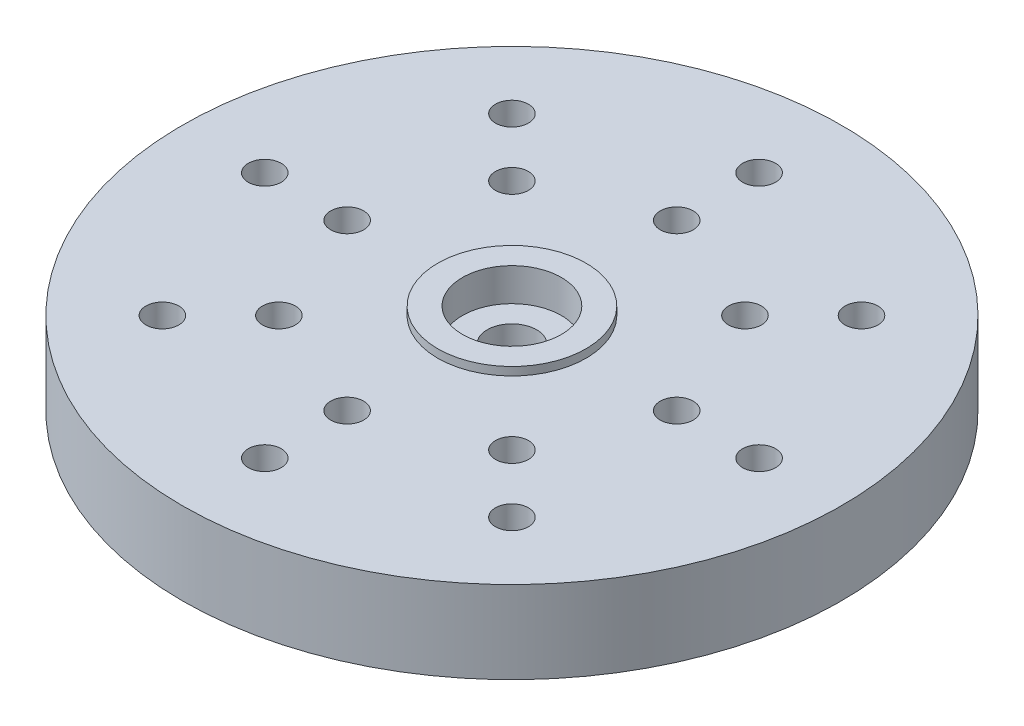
ISO-10303-21;
HEADER;
FILE_DESCRIPTION(('STEP AP214'),'2;1');
FILE_NAME('part.step','',(''),(''),'','','');
FILE_SCHEMA(('AUTOMOTIVE_DESIGN { 1 0 10303 214 1 1 1 1 }'));
ENDSEC;
DATA;
#1=APPLICATION_CONTEXT('core data for automotive mechanical design processes');
#2=APPLICATION_PROTOCOL_DEFINITION('international standard','automotive_design',2000,#1);
#3=PRODUCT_CONTEXT('',#1,'mechanical');
#4=PRODUCT('Part','Part','',(#3));
#5=PRODUCT_RELATED_PRODUCT_CATEGORY('part','',(#4));
#6=PRODUCT_DEFINITION_FORMATION('','',#4);
#7=PRODUCT_DEFINITION_CONTEXT('part definition',#1,'design');
#8=PRODUCT_DEFINITION('design','',#6,#7);
#9=PRODUCT_DEFINITION_SHAPE('','',#8);
#10=(LENGTH_UNIT() NAMED_UNIT(*) SI_UNIT(.MILLI.,.METRE.));
#11=(NAMED_UNIT(*) PLANE_ANGLE_UNIT() SI_UNIT($,.RADIAN.));
#12=(NAMED_UNIT(*) SI_UNIT($,.STERADIAN.) SOLID_ANGLE_UNIT());
#13=UNCERTAINTY_MEASURE_WITH_UNIT(LENGTH_MEASURE(1.E-05),#10,'distance_accuracy_value','');
#14=(GEOMETRIC_REPRESENTATION_CONTEXT(3) GLOBAL_UNCERTAINTY_ASSIGNED_CONTEXT((#13)) GLOBAL_UNIT_ASSIGNED_CONTEXT((#10,
#11,#12)) REPRESENTATION_CONTEXT('',''));
#15=CARTESIAN_POINT('',(0.,0.,0.));
#16=DIRECTION('',(0.,0.,1.));
#17=DIRECTION('',(1.,0.,0.));
#18=AXIS2_PLACEMENT_3D('',#15,#16,#17);
#19=CARTESIAN_POINT('',(0.,5.,0.));
#20=DIRECTION('',(0.,-1.,0.));
#21=DIRECTION('',(0.,0.,-1.));
#22=AXIS2_PLACEMENT_3D('',#19,#20,#21);
#23=CYLINDRICAL_SURFACE('',#22,3.75);
#24=DIRECTION('',(0.,-1.,0.));
#25=VECTOR('',#24,1.);
#26=CARTESIAN_POINT('',(-0.858971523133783,5.,3.65029696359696));
#27=LINE('',#26,#25);
#28=CARTESIAN_POINT('',(-0.858971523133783,0.0400000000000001,3.65029696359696));
#29=VERTEX_POINT('',#28);
#30=CARTESIAN_POINT('',(-0.858971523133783,-3.,3.65029696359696));
#31=VERTEX_POINT('',#30);
#32=EDGE_CURVE('E55',#29,#31,#27,.T.);
#33=ORIENTED_EDGE('',*,*,#32,.F.);
#34=CARTESIAN_POINT('',(0.,0.0400000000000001,0.));
#35=DIRECTION('',(0.,1.,0.));
#36=DIRECTION('',(0.,0.,1.));
#37=AXIS2_PLACEMENT_3D('',#34,#35,#36);
#38=CIRCLE('',#37,3.75);
#39=CARTESIAN_POINT('',(-0.699999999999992,0.0400000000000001,3.68408740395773));
#40=VERTEX_POINT('',#39);
#41=EDGE_CURVE('E48',#29,#40,#38,.T.);
#42=ORIENTED_EDGE('',*,*,#41,.T.);
#43=DIRECTION('',(0.,-1.,0.));
#44=VECTOR('',#43,1.);
#45=CARTESIAN_POINT('',(-0.699999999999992,5.,3.68408740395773));
#46=LINE('',#45,#44);
#47=CARTESIAN_POINT('',(-0.699999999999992,-3.,3.68408740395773));
#48=VERTEX_POINT('',#47);
#49=EDGE_CURVE('E348',#40,#48,#46,.T.);
#50=ORIENTED_EDGE('',*,*,#49,.T.);
#51=CARTESIAN_POINT('',(0.,-3.,0.));
#52=DIRECTION('',(0.,-1.,0.));
#53=DIRECTION('',(0.,0.,-1.));
#54=AXIS2_PLACEMENT_3D('',#51,#52,#53);
#55=CIRCLE('',#54,3.75);
#56=EDGE_CURVE('E764',#31,#48,#55,.F.);
#57=ORIENTED_EDGE('',*,*,#56,.F.);
#58=EDGE_LOOP('',(#33,#42,#50,#57));
#59=FACE_BOUND('',#58,.T.);
#60=ADVANCED_FACE('F33',(#59),#23,.F.);
#61=CARTESIAN_POINT('',(1.51757307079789,5.,1.67532290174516));
#62=DIRECTION('',(0.671352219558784,0.,0.741138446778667));
#63=DIRECTION('',(0.741138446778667,0.,-0.671352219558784));
#64=AXIS2_PLACEMENT_3D('',#61,#62,#63);
#65=PLANE('',#64);
#66=DIRECTION('',(-0.741138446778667,0.,0.671352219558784));
#67=VECTOR('',#66,1.);
#68=CARTESIAN_POINT('',(1.51757307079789,0.0400000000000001,1.67532290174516));
#69=LINE('',#68,#67);
#70=CARTESIAN_POINT('',(0.,0.0400000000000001,3.05));
#71=VERTEX_POINT('',#70);
#72=EDGE_CURVE('E761',#71,#40,#69,.T.);
#73=ORIENTED_EDGE('',*,*,#72,.F.);
#74=DIRECTION('',(0.,-1.,0.));
#75=VECTOR('',#74,1.);
#76=CARTESIAN_POINT('',(0.,5.,3.05));
#77=LINE('',#76,#75);
#78=CARTESIAN_POINT('',(0.,-3.,3.05));
#79=VERTEX_POINT('',#78);
#80=EDGE_CURVE('E896',#71,#79,#77,.T.);
#81=ORIENTED_EDGE('',*,*,#80,.T.);
#82=DIRECTION('',(-0.741138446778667,0.,0.671352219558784));
#83=VECTOR('',#82,1.);
#84=CARTESIAN_POINT('',(1.51757307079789,-3.,1.67532290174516));
#85=LINE('',#84,#83);
#86=EDGE_CURVE('E340',#79,#48,#85,.T.);
#87=ORIENTED_EDGE('',*,*,#86,.T.);
#88=ORIENTED_EDGE('',*,*,#49,.F.);
#89=EDGE_LOOP('',(#73,#81,#87,#88));
#90=FACE_BOUND('',#89,.T.);
#91=ADVANCED_FACE('F472',(#90),#65,.F.);
#92=CARTESIAN_POINT('',(-1.51757307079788,5.,1.67532290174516));
#93=DIRECTION('',(0.671352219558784,0.,-0.741138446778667));
#94=DIRECTION('',(-0.741138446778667,0.,-0.671352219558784));
#95=AXIS2_PLACEMENT_3D('',#92,#93,#94);
#96=PLANE('',#95);
#97=ORIENTED_EDGE('',*,*,#80,.F.);
#98=DIRECTION('',(0.741138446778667,0.,0.671352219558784));
#99=VECTOR('',#98,1.);
#100=CARTESIAN_POINT('',(-1.51757307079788,0.0400000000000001,1.67532290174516));
#101=LINE('',#100,#99);
#102=CARTESIAN_POINT('',(0.700000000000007,0.0400000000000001,3.68408740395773));
#103=VERTEX_POINT('',#102);
#104=EDGE_CURVE('E758',#71,#103,#101,.T.);
#105=ORIENTED_EDGE('',*,*,#104,.T.);
#106=DIRECTION('',(0.,-1.,0.));
#107=VECTOR('',#106,1.);
#108=CARTESIAN_POINT('',(0.700000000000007,5.,3.68408740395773));
#109=LINE('',#108,#107);
#110=CARTESIAN_POINT('',(0.700000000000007,-3.,3.68408740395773));
#111=VERTEX_POINT('',#110);
#112=EDGE_CURVE('E898',#103,#111,#109,.T.);
#113=ORIENTED_EDGE('',*,*,#112,.T.);
#114=DIRECTION('',(0.741138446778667,0.,0.671352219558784));
#115=VECTOR('',#114,1.);
#116=CARTESIAN_POINT('',(-1.51757307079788,-3.,1.67532290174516));
#117=LINE('',#116,#115);
#118=EDGE_CURVE('E890',#79,#111,#117,.T.);
#119=ORIENTED_EDGE('',*,*,#118,.F.);
#120=EDGE_LOOP('',(#97,#105,#113,#119));
#121=FACE_BOUND('',#120,.T.);
#122=ADVANCED_FACE('F478',(#121),#96,.T.);
#123=CARTESIAN_POINT('',(0.,5.,0.));
#124=DIRECTION('',(0.,-1.,0.));
#125=DIRECTION('',(0.,0.,-1.));
#126=AXIS2_PLACEMENT_3D('',#123,#124,#125);
#127=CYLINDRICAL_SURFACE('',#126,3.75);
#128=ORIENTED_EDGE('',*,*,#112,.F.);
#129=CARTESIAN_POINT('',(0.,0.0400000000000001,0.));
#130=DIRECTION('',(0.,1.,0.));
#131=DIRECTION('',(0.,0.,1.));
#132=AXIS2_PLACEMENT_3D('',#129,#130,#131);
#133=CIRCLE('',#132,3.75);
#134=CARTESIAN_POINT('',(0.858971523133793,0.0400000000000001,3.65029696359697));
#135=VERTEX_POINT('',#134);
#136=EDGE_CURVE('E755',#103,#135,#133,.T.);
#137=ORIENTED_EDGE('',*,*,#136,.T.);
#138=DIRECTION('',(0.,-1.,0.));
#139=VECTOR('',#138,1.);
#140=CARTESIAN_POINT('',(0.858971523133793,5.,3.65029696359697));
#141=LINE('',#140,#139);
#142=CARTESIAN_POINT('',(0.858971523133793,-3.,3.65029696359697));
#143=VERTEX_POINT('',#142);
#144=EDGE_CURVE('E900',#135,#143,#141,.T.);
#145=ORIENTED_EDGE('',*,*,#144,.T.);
#146=CARTESIAN_POINT('',(0.,-3.,0.));
#147=DIRECTION('',(0.,-1.,0.));
#148=DIRECTION('',(0.,0.,-1.));
#149=AXIS2_PLACEMENT_3D('',#146,#147,#148);
#150=CIRCLE('',#149,3.75);
#151=EDGE_CURVE('E887',#111,#143,#150,.F.);
#152=ORIENTED_EDGE('',*,*,#151,.F.);
#153=EDGE_LOOP('',(#128,#137,#145,#152));
#154=FACE_BOUND('',#153,.T.);
#155=ADVANCED_FACE('F1147',(#154),#127,.F.);
#156=CARTESIAN_POINT('',(2.06778719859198,5.,0.913231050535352));
#157=DIRECTION('',(0.914758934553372,0.,0.404000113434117));
#158=DIRECTION('',(0.404000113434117,0.,-0.914758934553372));
#159=AXIS2_PLACEMENT_3D('',#156,#157,#158);
#160=PLANE('',#159);
#161=DIRECTION('',(-0.404000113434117,0.,0.914758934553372));
#162=VECTOR('',#161,1.);
#163=CARTESIAN_POINT('',(2.06778719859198,0.0400000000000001,0.913231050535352));
#164=LINE('',#163,#162);
#165=CARTESIAN_POINT('',(1.2405467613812,0.0400000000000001,2.78631364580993));
#166=VERTEX_POINT('',#165);
#167=EDGE_CURVE('E753',#166,#135,#164,.T.);
#168=ORIENTED_EDGE('',*,*,#167,.F.);
#169=DIRECTION('',(0.,-1.,0.));
#170=VECTOR('',#169,1.);
#171=CARTESIAN_POINT('',(1.2405467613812,5.,2.78631364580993));
#172=LINE('',#171,#170);
#173=CARTESIAN_POINT('',(1.2405467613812,-3.,2.78631364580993));
#174=VERTEX_POINT('',#173);
#175=EDGE_CURVE('E902',#166,#174,#172,.T.);
#176=ORIENTED_EDGE('',*,*,#175,.T.);
#177=DIRECTION('',(-0.404000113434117,0.,0.914758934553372));
#178=VECTOR('',#177,1.);
#179=CARTESIAN_POINT('',(2.06778719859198,-3.,0.913231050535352));
#180=LINE('',#179,#178);
#181=EDGE_CURVE('E884',#174,#143,#180,.T.);
#182=ORIENTED_EDGE('',*,*,#181,.T.);
#183=ORIENTED_EDGE('',*,*,#144,.F.);
#184=EDGE_LOOP('',(#168,#176,#182,#183));
#185=FACE_BOUND('',#184,.T.);
#186=ADVANCED_FACE('F1143',(#185),#160,.F.);
#187=CARTESIAN_POINT('',(-0.704956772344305,5.,2.14773620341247));
#188=DIRECTION('',(0.311862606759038,0.,-0.950127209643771));
#189=DIRECTION('',(-0.950127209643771,0.,-0.311862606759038));
#190=AXIS2_PLACEMENT_3D('',#187,#188,#189);
#191=PLANE('',#190);
#192=ORIENTED_EDGE('',*,*,#175,.F.);
#193=DIRECTION('',(0.950127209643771,0.,0.311862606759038));
#194=VECTOR('',#193,1.);
#195=CARTESIAN_POINT('',(-0.704956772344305,0.0400000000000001,2.14773620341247));
#196=LINE('',#195,#194);
#197=CARTESIAN_POINT('',(2.13793516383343,0.0400000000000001,3.08086566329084));
#198=VERTEX_POINT('',#197);
#199=EDGE_CURVE('E750',#166,#198,#196,.T.);
#200=ORIENTED_EDGE('',*,*,#199,.T.);
#201=DIRECTION('',(0.,-1.,0.));
#202=VECTOR('',#201,1.);
#203=CARTESIAN_POINT('',(2.13793516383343,5.,3.08086566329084));
#204=LINE('',#203,#202);
#205=CARTESIAN_POINT('',(2.13793516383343,-3.,3.08086566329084));
#206=VERTEX_POINT('',#205);
#207=EDGE_CURVE('E904',#198,#206,#204,.T.);
#208=ORIENTED_EDGE('',*,*,#207,.T.);
#209=DIRECTION('',(0.950127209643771,0.,0.311862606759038));
#210=VECTOR('',#209,1.);
#211=CARTESIAN_POINT('',(-0.704956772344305,-3.,2.14773620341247));
#212=LINE('',#211,#210);
#213=EDGE_CURVE('E881',#174,#206,#212,.T.);
#214=ORIENTED_EDGE('',*,*,#213,.F.);
#215=EDGE_LOOP('',(#192,#200,#208,#214));
#216=FACE_BOUND('',#215,.T.);
#217=ADVANCED_FACE('F1139',(#216),#191,.T.);
#218=CARTESIAN_POINT('',(0.,5.,0.));
#219=DIRECTION('',(0.,-1.,0.));
#220=DIRECTION('',(0.,0.,-1.));
#221=AXIS2_PLACEMENT_3D('',#218,#219,#220);
#222=CYLINDRICAL_SURFACE('',#221,3.75);
#223=ORIENTED_EDGE('',*,*,#207,.F.);
#224=CARTESIAN_POINT('',(0.,0.0400000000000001,0.));
#225=DIRECTION('',(0.,1.,0.));
#226=DIRECTION('',(0.,0.,1.));
#227=AXIS2_PLACEMENT_3D('',#224,#225,#226);
#228=CIRCLE('',#227,3.75);
#229=CARTESIAN_POINT('',(2.26941906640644,0.0400000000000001,2.98533701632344));
#230=VERTEX_POINT('',#229);
#231=EDGE_CURVE('E747',#198,#230,#228,.T.);
#232=ORIENTED_EDGE('',*,*,#231,.T.);
#233=DIRECTION('',(0.,-1.,0.));
#234=VECTOR('',#233,1.);
#235=CARTESIAN_POINT('',(2.26941906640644,5.,2.98533701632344));
#236=LINE('',#235,#234);
#237=CARTESIAN_POINT('',(2.26941906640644,-3.,2.98533701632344));
#238=VERTEX_POINT('',#237);
#239=EDGE_CURVE('E906',#230,#238,#236,.T.);
#240=ORIENTED_EDGE('',*,*,#239,.T.);
#241=CARTESIAN_POINT('',(0.,-3.,0.));
#242=DIRECTION('',(0.,-1.,0.));
#243=DIRECTION('',(0.,0.,-1.));
#244=AXIS2_PLACEMENT_3D('',#241,#242,#243);
#245=CIRCLE('',#244,3.75);
#246=EDGE_CURVE('E878',#206,#238,#245,.F.);
#247=ORIENTED_EDGE('',*,*,#246,.F.);
#248=EDGE_LOOP('',(#223,#232,#240,#247));
#249=FACE_BOUND('',#248,.T.);
#250=ADVANCED_FACE('F1135',(#249),#222,.F.);
#251=CARTESIAN_POINT('',(2.26046213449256,5.,-0.00676674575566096));
#252=DIRECTION('',(0.999995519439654,0.,-0.00299350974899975));
#253=DIRECTION('',(-0.00299350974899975,0.,-0.999995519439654));
#254=AXIS2_PLACEMENT_3D('',#251,#252,#253);
#255=PLANE('',#254);
#256=DIRECTION('',(0.00299350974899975,0.,0.999995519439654));
#257=VECTOR('',#256,1.);
#258=CARTESIAN_POINT('',(2.26046213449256,0.0400000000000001,-0.00676674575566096));
#259=LINE('',#258,#257);
#260=CARTESIAN_POINT('',(2.26659171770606,0.0400000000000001,2.04084834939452));
#261=VERTEX_POINT('',#260);
#262=EDGE_CURVE('E745',#261,#230,#259,.T.);
#263=ORIENTED_EDGE('',*,*,#262,.F.);
#264=DIRECTION('',(0.,-1.,0.));
#265=VECTOR('',#264,1.);
#266=CARTESIAN_POINT('',(2.26659171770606,5.,2.04084834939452));
#267=LINE('',#266,#265);
#268=CARTESIAN_POINT('',(2.26659171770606,-3.,2.04084834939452));
#269=VERTEX_POINT('',#268);
#270=EDGE_CURVE('E908',#261,#269,#267,.T.);
#271=ORIENTED_EDGE('',*,*,#270,.T.);
#272=DIRECTION('',(0.00299350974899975,0.,0.999995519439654));
#273=VECTOR('',#272,1.);
#274=CARTESIAN_POINT('',(2.26046213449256,-3.,-0.00676674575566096));
#275=LINE('',#274,#273);
#276=EDGE_CURVE('E875',#269,#238,#275,.T.);
#277=ORIENTED_EDGE('',*,*,#276,.T.);
#278=ORIENTED_EDGE('',*,*,#239,.F.);
#279=EDGE_LOOP('',(#263,#271,#277,#278));
#280=FACE_BOUND('',#279,.T.);
#281=ADVANCED_FACE('F1131',(#280),#255,.F.);
#282=CARTESIAN_POINT('',(0.229552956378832,5.,2.24878640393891));
#283=DIRECTION('',(-0.101550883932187,0.,-0.994830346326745));
#284=DIRECTION('',(-0.994830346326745,0.,0.101550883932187));
#285=AXIS2_PLACEMENT_3D('',#282,#283,#284);
#286=PLANE('',#285);
#287=ORIENTED_EDGE('',*,*,#270,.F.);
#288=DIRECTION('',(0.994830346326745,0.,-0.101550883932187));
#289=VECTOR('',#288,1.);
#290=CARTESIAN_POINT('',(0.229552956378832,0.0400000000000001,2.24878640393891));
#291=LINE('',#290,#289);
#292=CARTESIAN_POINT('',(3.20620191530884,0.0400000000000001,1.94493426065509));
#293=VERTEX_POINT('',#292);
#294=EDGE_CURVE('E742',#261,#293,#291,.T.);
#295=ORIENTED_EDGE('',*,*,#294,.T.);
#296=DIRECTION('',(0.,-1.,0.));
#297=VECTOR('',#296,1.);
#298=CARTESIAN_POINT('',(3.20620191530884,5.,1.94493426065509));
#299=LINE('',#298,#297);
#300=CARTESIAN_POINT('',(3.20620191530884,-3.,1.94493426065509));
#301=VERTEX_POINT('',#300);
#302=EDGE_CURVE('E910',#293,#301,#299,.T.);
#303=ORIENTED_EDGE('',*,*,#302,.T.);
#304=DIRECTION('',(0.994830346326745,0.,-0.101550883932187));
#305=VECTOR('',#304,1.);
#306=CARTESIAN_POINT('',(0.229552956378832,-3.,2.24878640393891));
#307=LINE('',#306,#305);
#308=EDGE_CURVE('E872',#269,#301,#307,.T.);
#309=ORIENTED_EDGE('',*,*,#308,.F.);
#310=EDGE_LOOP('',(#287,#295,#303,#309));
#311=FACE_BOUND('',#310,.T.);
#312=ADVANCED_FACE('F1126',(#311),#286,.T.);
#313=CARTESIAN_POINT('',(0.,5.,0.));
#314=DIRECTION('',(0.,-1.,0.));
#315=DIRECTION('',(0.,0.,-1.));
#316=AXIS2_PLACEMENT_3D('',#313,#314,#315);
#317=CYLINDRICAL_SURFACE('',#316,3.75);
#318=ORIENTED_EDGE('',*,*,#302,.F.);
#319=CARTESIAN_POINT('',(0.,0.0400000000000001,0.));
#320=DIRECTION('',(0.,1.,0.));
#321=DIRECTION('',(0.,0.,1.));
#322=AXIS2_PLACEMENT_3D('',#319,#320,#321);
#323=CIRCLE('',#322,3.75);
#324=CARTESIAN_POINT('',(3.28746343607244,0.0400000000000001,1.80418517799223));
#325=VERTEX_POINT('',#324);
#326=EDGE_CURVE('E739',#293,#325,#323,.T.);
#327=ORIENTED_EDGE('',*,*,#326,.T.);
#328=DIRECTION('',(0.,-1.,0.));
#329=VECTOR('',#328,1.);
#330=CARTESIAN_POINT('',(3.28746343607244,5.,1.80418517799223));
#331=LINE('',#330,#329);
#332=CARTESIAN_POINT('',(3.28746343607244,-3.,1.80418517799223));
#333=VERTEX_POINT('',#332);
#334=EDGE_CURVE('E912',#325,#333,#331,.T.);
#335=ORIENTED_EDGE('',*,*,#334,.T.);
#336=CARTESIAN_POINT('',(0.,-3.,0.));
#337=DIRECTION('',(0.,-1.,0.));
#338=DIRECTION('',(0.,0.,-1.));
#339=AXIS2_PLACEMENT_3D('',#336,#337,#338);
#340=CIRCLE('',#339,3.75);
#341=EDGE_CURVE('E869',#301,#333,#340,.F.);
#342=ORIENTED_EDGE('',*,*,#341,.F.);
#343=EDGE_LOOP('',(#318,#327,#335,#342));
#344=FACE_BOUND('',#343,.T.);
#345=ADVANCED_FACE('F1121',(#344),#317,.F.);
#346=CARTESIAN_POINT('',(2.06228263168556,5.,-0.925594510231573));
#347=DIRECTION('',(0.912323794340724,0.,-0.409469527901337));
#348=DIRECTION('',(-0.409469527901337,0.,-0.912323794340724));
#349=AXIS2_PLACEMENT_3D('',#346,#347,#348);
#350=PLANE('',#349);
#351=DIRECTION('',(0.409469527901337,0.,0.912323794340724));
#352=VECTOR('',#351,1.);
#353=CARTESIAN_POINT('',(2.06228263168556,0.0400000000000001,-0.925594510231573));
#354=LINE('',#353,#352);
#355=CARTESIAN_POINT('',(2.90072237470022,0.0400000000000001,0.942501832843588));
#356=VERTEX_POINT('',#355);
#357=EDGE_CURVE('E737',#356,#325,#354,.T.);
#358=ORIENTED_EDGE('',*,*,#357,.F.);
#359=DIRECTION('',(0.,-1.,0.));
#360=VECTOR('',#359,1.);
#361=CARTESIAN_POINT('',(2.90072237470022,5.,0.942501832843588));
#362=LINE('',#361,#360);
#363=CARTESIAN_POINT('',(2.90072237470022,-3.,0.942501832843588));
#364=VERTEX_POINT('',#363);
#365=EDGE_CURVE('E914',#356,#364,#362,.T.);
#366=ORIENTED_EDGE('',*,*,#365,.T.);
#367=DIRECTION('',(0.409469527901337,0.,0.912323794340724));
#368=VECTOR('',#367,1.);
#369=CARTESIAN_POINT('',(2.06228263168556,-3.,-0.925594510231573));
#370=LINE('',#369,#368);
#371=EDGE_CURVE('E866',#364,#333,#370,.T.);
#372=ORIENTED_EDGE('',*,*,#371,.T.);
#373=ORIENTED_EDGE('',*,*,#334,.F.);
#374=EDGE_LOOP('',(#358,#366,#372,#373));
#375=FACE_BOUND('',#374,.T.);
#376=ADVANCED_FACE('F1117',(#375),#350,.F.);
#377=CARTESIAN_POINT('',(1.1243708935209,5.,1.96100100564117));
#378=DIRECTION('',(-0.49740530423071,0.,-0.867518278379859));
#379=DIRECTION('',(-0.867518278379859,0.,0.49740530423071));
#380=AXIS2_PLACEMENT_3D('',#377,#378,#379);
#381=PLANE('',#380);
#382=ORIENTED_EDGE('',*,*,#365,.F.);
#383=DIRECTION('',(0.867518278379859,0.,-0.49740530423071));
#384=VECTOR('',#383,1.);
#385=CARTESIAN_POINT('',(1.1243708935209,0.0400000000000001,1.96100100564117));
#386=LINE('',#385,#384);
#387=CARTESIAN_POINT('',(3.72008722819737,0.0400000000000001,0.472706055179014));
#388=VERTEX_POINT('',#387);
#389=EDGE_CURVE('E734',#356,#388,#386,.T.);
#390=ORIENTED_EDGE('',*,*,#389,.T.);
#391=DIRECTION('',(0.,-1.,0.));
#392=VECTOR('',#391,1.);
#393=CARTESIAN_POINT('',(3.72008722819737,5.,0.472706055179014));
#394=LINE('',#393,#392);
#395=CARTESIAN_POINT('',(3.72008722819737,-3.,0.472706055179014));
#396=VERTEX_POINT('',#395);
#397=EDGE_CURVE('E916',#388,#396,#394,.T.);
#398=ORIENTED_EDGE('',*,*,#397,.T.);
#399=DIRECTION('',(0.867518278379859,0.,-0.49740530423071));
#400=VECTOR('',#399,1.);
#401=CARTESIAN_POINT('',(1.1243708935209,-3.,1.96100100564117));
#402=LINE('',#401,#400);
#403=EDGE_CURVE('E863',#364,#396,#402,.T.);
#404=ORIENTED_EDGE('',*,*,#403,.F.);
#405=EDGE_LOOP('',(#382,#390,#398,#404));
#406=FACE_BOUND('',#405,.T.);
#407=ADVANCED_FACE('F1113',(#406),#381,.T.);
#408=CARTESIAN_POINT('',(0.,5.,0.));
#409=DIRECTION('',(0.,-1.,0.));
#410=DIRECTION('',(0.,0.,-1.));
#411=AXIS2_PLACEMENT_3D('',#408,#409,#410);
#412=CYLINDRICAL_SURFACE('',#411,3.75000000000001);
#413=ORIENTED_EDGE('',*,*,#397,.F.);
#414=CARTESIAN_POINT('',(0.,0.0400000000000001,0.));
#415=DIRECTION('',(0.,1.,0.));
#416=DIRECTION('',(0.,0.,1.));
#417=AXIS2_PLACEMENT_3D('',#414,#415,#416);
#418=CIRCLE('',#417,3.75000000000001);
#419=CARTESIAN_POINT('',(3.73707551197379,0.0400000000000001,0.311073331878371));
#420=VERTEX_POINT('',#419);
#421=EDGE_CURVE('E731',#388,#420,#418,.T.);
#422=ORIENTED_EDGE('',*,*,#421,.T.);
#423=DIRECTION('',(0.,-1.,0.));
#424=VECTOR('',#423,1.);
#425=CARTESIAN_POINT('',(3.73707551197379,5.,0.31107333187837));
#426=LINE('',#425,#424);
#427=CARTESIAN_POINT('',(3.73707551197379,-3.,0.31107333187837));
#428=VERTEX_POINT('',#427);
#429=EDGE_CURVE('E918',#420,#428,#426,.T.);
#430=ORIENTED_EDGE('',*,*,#429,.T.);
#431=CARTESIAN_POINT('',(0.,-3.,0.));
#432=DIRECTION('',(0.,-1.,0.));
#433=DIRECTION('',(0.,0.,-1.));
#434=AXIS2_PLACEMENT_3D('',#431,#432,#433);
#435=CIRCLE('',#434,3.75000000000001);
#436=EDGE_CURVE('E860',#396,#428,#435,.F.);
#437=ORIENTED_EDGE('',*,*,#436,.F.);
#438=EDGE_LOOP('',(#413,#422,#430,#437));
#439=FACE_BOUND('',#438,.T.);
#440=ADVANCED_FACE('F1109',(#439),#412,.F.);
#441=CARTESIAN_POINT('',(1.5075157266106,5.,-1.68437857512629));
#442=DIRECTION('',(0.66690299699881,0.,-0.745144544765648));
#443=DIRECTION('',(-0.745144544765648,0.,-0.66690299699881));
#444=AXIS2_PLACEMENT_3D('',#441,#442,#443);
#445=PLANE('',#444);
#446=DIRECTION('',(0.745144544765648,0.,0.66690299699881));
#447=VECTOR('',#446,1.);
#448=CARTESIAN_POINT('',(1.5075157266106,0.0400000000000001,-1.68437857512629));
#449=LINE('',#448,#447);
#450=CARTESIAN_POINT('',(3.03329178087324,0.0400000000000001,-0.318811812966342));
#451=VERTEX_POINT('',#450);
#452=EDGE_CURVE('E729',#451,#420,#449,.T.);
#453=ORIENTED_EDGE('',*,*,#452,.F.);
#454=DIRECTION('',(0.,-1.,0.));
#455=VECTOR('',#454,1.);
#456=CARTESIAN_POINT('',(3.03329178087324,5.,-0.318811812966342));
#457=LINE('',#456,#455);
#458=CARTESIAN_POINT('',(3.03329178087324,-3.,-0.318811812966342));
#459=VERTEX_POINT('',#458);
#460=EDGE_CURVE('E920',#451,#459,#457,.T.);
#461=ORIENTED_EDGE('',*,*,#460,.T.);
#462=DIRECTION('',(0.745144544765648,0.,0.66690299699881));
#463=VECTOR('',#462,1.);
#464=CARTESIAN_POINT('',(1.5075157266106,-3.,-1.68437857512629));
#465=LINE('',#464,#463);
#466=EDGE_CURVE('E857',#459,#428,#465,.T.);
#467=ORIENTED_EDGE('',*,*,#466,.T.);
#468=ORIENTED_EDGE('',*,*,#429,.F.);
#469=EDGE_LOOP('',(#453,#461,#467,#468));
#470=FACE_BOUND('',#469,.T.);
#471=ADVANCED_FACE('F1105',(#470),#445,.F.);
#472=CARTESIAN_POINT('',(1.82477488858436,5.,1.33414071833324));
#473=DIRECTION('',(-0.807253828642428,0.,-0.590204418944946));
#474=DIRECTION('',(-0.590204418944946,0.,0.807253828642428));
#475=AXIS2_PLACEMENT_3D('',#472,#473,#474);
#476=PLANE('',#475);
#477=ORIENTED_EDGE('',*,*,#460,.F.);
#478=DIRECTION('',(0.590204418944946,0.,-0.807253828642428));
#479=VECTOR('',#478,1.);
#480=CARTESIAN_POINT('',(1.82477488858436,0.0400000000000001,1.33414071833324));
#481=LINE('',#480,#479);
#482=CARTESIAN_POINT('',(3.59073566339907,0.0400000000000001,-1.08125732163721));
#483=VERTEX_POINT('',#482);
#484=EDGE_CURVE('E726',#451,#483,#481,.T.);
#485=ORIENTED_EDGE('',*,*,#484,.T.);
#486=DIRECTION('',(0.,-1.,0.));
#487=VECTOR('',#486,1.);
#488=CARTESIAN_POINT('',(3.59073566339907,5.,-1.08125732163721));
#489=LINE('',#488,#487);
#490=CARTESIAN_POINT('',(3.59073566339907,-3.,-1.08125732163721));
#491=VERTEX_POINT('',#490);
#492=EDGE_CURVE('E922',#483,#491,#489,.T.);
#493=ORIENTED_EDGE('',*,*,#492,.T.);
#494=DIRECTION('',(0.590204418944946,0.,-0.807253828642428));
#495=VECTOR('',#494,1.);
#496=CARTESIAN_POINT('',(1.82477488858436,-3.,1.33414071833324));
#497=LINE('',#496,#495);
#498=EDGE_CURVE('E854',#459,#491,#497,.T.);
#499=ORIENTED_EDGE('',*,*,#498,.F.);
#500=EDGE_LOOP('',(#477,#485,#493,#499));
#501=FACE_BOUND('',#500,.T.);
#502=ADVANCED_FACE('F1100',(#501),#476,.T.);
#503=CARTESIAN_POINT('',(0.,5.,0.));
#504=DIRECTION('',(0.,-1.,0.));
#505=DIRECTION('',(0.,0.,-1.));
#506=AXIS2_PLACEMENT_3D('',#503,#504,#505);
#507=CYLINDRICAL_SURFACE('',#506,3.75);
#508=ORIENTED_EDGE('',*,*,#492,.F.);
#509=CARTESIAN_POINT('',(0.,0.0400000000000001,0.));
#510=DIRECTION('',(0.,1.,0.));
#511=DIRECTION('',(0.,0.,1.));
#512=AXIS2_PLACEMENT_3D('',#509,#510,#511);
#513=CIRCLE('',#512,3.75);
#514=CARTESIAN_POINT('',(3.54051328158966,0.0400000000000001,-1.23582591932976));
#515=VERTEX_POINT('',#514);
#516=EDGE_CURVE('E723',#483,#515,#513,.T.);
#517=ORIENTED_EDGE('',*,*,#516,.T.);
#518=DIRECTION('',(0.,-1.,0.));
#519=VECTOR('',#518,1.);
#520=CARTESIAN_POINT('',(3.54051328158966,5.,-1.23582591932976));
#521=LINE('',#520,#519);
#522=CARTESIAN_POINT('',(3.54051328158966,-3.,-1.23582591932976));
#523=VERTEX_POINT('',#522);
#524=EDGE_CURVE('E924',#515,#523,#521,.T.);
#525=ORIENTED_EDGE('',*,*,#524,.T.);
#526=CARTESIAN_POINT('',(0.,-3.,0.));
#527=DIRECTION('',(0.,-1.,0.));
#528=DIRECTION('',(0.,0.,-1.));
#529=AXIS2_PLACEMENT_3D('',#526,#527,#528);
#530=CIRCLE('',#529,3.75);
#531=EDGE_CURVE('E851',#491,#523,#530,.F.);
#532=ORIENTED_EDGE('',*,*,#531,.F.);
#533=EDGE_LOOP('',(#508,#517,#525,#532));
#534=FACE_BOUND('',#533,.T.);
#535=ADVANCED_FACE('F1095',(#534),#507,.F.);
#536=CARTESIAN_POINT('',(0.692085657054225,5.,-2.15191828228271));
#537=DIRECTION('',(0.306168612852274,0.,-0.951977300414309));
#538=DIRECTION('',(-0.951977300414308,0.,-0.306168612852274));
#539=AXIS2_PLACEMENT_3D('',#536,#537,#538);
#540=PLANE('',#539);
#541=DIRECTION('',(0.951977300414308,0.,0.306168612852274));
#542=VECTOR('',#541,1.);
#543=CARTESIAN_POINT('',(0.692085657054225,0.0400000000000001,-2.15191828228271));
#544=LINE('',#543,#542);
#545=CARTESIAN_POINT('',(2.64137748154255,0.0400000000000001,-1.525));
#546=VERTEX_POINT('',#545);
#547=EDGE_CURVE('E721',#546,#515,#544,.T.);
#548=ORIENTED_EDGE('',*,*,#547,.F.);
#549=DIRECTION('',(0.,-1.,0.));
#550=VECTOR('',#549,1.);
#551=CARTESIAN_POINT('',(2.64137748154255,5.,-1.525));
#552=LINE('',#551,#550);
#553=CARTESIAN_POINT('',(2.64137748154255,-3.,-1.525));
#554=VERTEX_POINT('',#553);
#555=EDGE_CURVE('E926',#546,#554,#552,.T.);
#556=ORIENTED_EDGE('',*,*,#555,.T.);
#557=DIRECTION('',(0.951977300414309,0.,0.306168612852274));
#558=VECTOR('',#557,1.);
#559=CARTESIAN_POINT('',(0.692085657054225,-3.,-2.15191828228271));
#560=LINE('',#559,#558);
#561=EDGE_CURVE('E848',#554,#523,#560,.T.);
#562=ORIENTED_EDGE('',*,*,#561,.T.);
#563=ORIENTED_EDGE('',*,*,#524,.F.);
#564=EDGE_LOOP('',(#548,#556,#562,#563));
#565=FACE_BOUND('',#564,.T.);
#566=ADVANCED_FACE('F1091',(#565),#540,.F.);
#567=CARTESIAN_POINT('',(2.20965872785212,5.,0.476595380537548));
#568=DIRECTION('',(-0.977520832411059,0.,-0.210838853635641));
#569=DIRECTION('',(-0.210838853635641,0.,0.977520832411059));
#570=AXIS2_PLACEMENT_3D('',#567,#568,#569);
#571=PLANE('',#570);
#572=ORIENTED_EDGE('',*,*,#555,.F.);
#573=DIRECTION('',(0.210838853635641,0.,-0.977520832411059));
#574=VECTOR('',#573,1.);
#575=CARTESIAN_POINT('',(2.20965872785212,0.0400000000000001,0.476595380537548));
#576=LINE('',#575,#574);
#577=CARTESIAN_POINT('',(2.84051328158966,0.0400000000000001,-2.44826148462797));
#578=VERTEX_POINT('',#577);
#579=EDGE_CURVE('E718',#546,#578,#576,.T.);
#580=ORIENTED_EDGE('',*,*,#579,.T.);
#581=DIRECTION('',(0.,-1.,0.));
#582=VECTOR('',#581,1.);
#583=CARTESIAN_POINT('',(2.84051328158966,5.,-2.44826148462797));
#584=LINE('',#583,#582);
#585=CARTESIAN_POINT('',(2.84051328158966,-3.,-2.44826148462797));
#586=VERTEX_POINT('',#585);
#587=EDGE_CURVE('E928',#578,#586,#584,.T.);
#588=ORIENTED_EDGE('',*,*,#587,.T.);
#589=DIRECTION('',(0.210838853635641,0.,-0.977520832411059));
#590=VECTOR('',#589,1.);
#591=CARTESIAN_POINT('',(2.20965872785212,-3.,0.476595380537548));
#592=LINE('',#591,#590);
#593=EDGE_CURVE('E845',#554,#586,#592,.T.);
#594=ORIENTED_EDGE('',*,*,#593,.F.);
#595=EDGE_LOOP('',(#572,#580,#588,#594));
#596=FACE_BOUND('',#595,.T.);
#597=ADVANCED_FACE('F1087',(#596),#571,.T.);
#598=CARTESIAN_POINT('',(0.,5.,0.));
#599=DIRECTION('',(0.,-1.,0.));
#600=DIRECTION('',(0.,0.,-1.));
#601=AXIS2_PLACEMENT_3D('',#598,#599,#600);
#602=CYLINDRICAL_SURFACE('',#601,3.75);
#603=ORIENTED_EDGE('',*,*,#587,.F.);
#604=CARTESIAN_POINT('',(0.,0.0400000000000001,0.));
#605=DIRECTION('',(0.,1.,0.));
#606=DIRECTION('',(0.,0.,1.));
#607=AXIS2_PLACEMENT_3D('',#604,#605,#606);
#608=CIRCLE('',#607,3.75);
#609=CARTESIAN_POINT('',(2.73176414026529,0.0400000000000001,-2.56903964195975));
#610=VERTEX_POINT('',#609);
#611=EDGE_CURVE('E715',#578,#610,#608,.T.);
#612=ORIENTED_EDGE('',*,*,#611,.T.);
#613=DIRECTION('',(0.,-1.,0.));
#614=VECTOR('',#613,1.);
#615=CARTESIAN_POINT('',(2.73176414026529,5.,-2.56903964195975));
#616=LINE('',#615,#614);
#617=CARTESIAN_POINT('',(2.73176414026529,-3.,-2.56903964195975));
#618=VERTEX_POINT('',#617);
#619=EDGE_CURVE('E930',#610,#618,#616,.T.);
#620=ORIENTED_EDGE('',*,*,#619,.T.);
#621=CARTESIAN_POINT('',(0.,-3.,0.));
#622=DIRECTION('',(0.,-1.,0.));
#623=DIRECTION('',(0.,0.,-1.));
#624=AXIS2_PLACEMENT_3D('',#621,#622,#623);
#625=CIRCLE('',#624,3.75);
#626=EDGE_CURVE('E842',#586,#618,#625,.F.);
#627=ORIENTED_EDGE('',*,*,#626,.F.);
#628=EDGE_LOOP('',(#603,#612,#620,#627));
#629=FACE_BOUND('',#628,.T.);
#630=ADVANCED_FACE('F1083',(#629),#602,.F.);
#631=CARTESIAN_POINT('',(-0.243012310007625,5.,-2.24737176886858));
#632=DIRECTION('',(-0.107505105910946,0.,-0.994204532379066));
#633=DIRECTION('',(-0.994204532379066,0.,0.107505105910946));
#634=AXIS2_PLACEMENT_3D('',#631,#632,#633);
#635=PLANE('',#634);
#636=DIRECTION('',(0.994204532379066,0.,-0.107505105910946));
#637=VECTOR('',#636,1.);
#638=CARTESIAN_POINT('',(-0.243012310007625,0.0400000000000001,-2.24737176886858));
#639=LINE('',#638,#637);
#640=CARTESIAN_POINT('',(1.79274501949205,0.0400000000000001,-2.46750183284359));
#641=VERTEX_POINT('',#640);
#642=EDGE_CURVE('E713',#641,#610,#639,.T.);
#643=ORIENTED_EDGE('',*,*,#642,.F.);
#644=DIRECTION('',(0.,-1.,0.));
#645=VECTOR('',#644,1.);
#646=CARTESIAN_POINT('',(1.79274501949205,5.,-2.46750183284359));
#647=LINE('',#646,#645);
#648=CARTESIAN_POINT('',(1.79274501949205,-3.,-2.46750183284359));
#649=VERTEX_POINT('',#648);
#650=EDGE_CURVE('E932',#641,#649,#647,.T.);
#651=ORIENTED_EDGE('',*,*,#650,.T.);
#652=DIRECTION('',(0.994204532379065,0.,-0.107505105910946));
#653=VECTOR('',#652,1.);
#654=CARTESIAN_POINT('',(-0.243012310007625,-3.,-2.24737176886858));
#655=LINE('',#654,#653);
#656=EDGE_CURVE('E839',#649,#618,#655,.T.);
#657=ORIENTED_EDGE('',*,*,#656,.T.);
#658=ORIENTED_EDGE('',*,*,#619,.F.);
#659=EDGE_LOOP('',(#643,#651,#657,#658));
#660=FACE_BOUND('',#659,.T.);
#661=ADVANCED_FACE('F1079',(#660),#635,.F.);
#662=CARTESIAN_POINT('',(2.21247249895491,5.,-0.463357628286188));
#663=DIRECTION('',(-0.978765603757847,0.,0.204982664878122));
#664=DIRECTION('',(0.204982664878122,0.,0.978765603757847));
#665=AXIS2_PLACEMENT_3D('',#662,#663,#664);
#666=PLANE('',#665);
#667=ORIENTED_EDGE('',*,*,#650,.F.);
#668=DIRECTION('',(-0.204982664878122,0.,-0.978765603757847));
#669=VECTOR('',#668,1.);
#670=CARTESIAN_POINT('',(2.21247249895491,0.0400000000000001,-0.463357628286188));
#671=LINE('',#670,#669);
#672=CARTESIAN_POINT('',(1.59914034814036,0.0400000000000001,-3.39193899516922));
#673=VERTEX_POINT('',#672);
#674=EDGE_CURVE('E710',#641,#673,#671,.T.);
#675=ORIENTED_EDGE('',*,*,#674,.T.);
#676=DIRECTION('',(0.,-1.,0.));
#677=VECTOR('',#676,1.);
#678=CARTESIAN_POINT('',(1.59914034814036,5.,-3.39193899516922));
#679=LINE('',#678,#677);
#680=CARTESIAN_POINT('',(1.59914034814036,-3.,-3.39193899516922));
#681=VERTEX_POINT('',#680);
#682=EDGE_CURVE('E934',#673,#681,#679,.T.);
#683=ORIENTED_EDGE('',*,*,#682,.T.);
#684=DIRECTION('',(-0.204982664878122,0.,-0.978765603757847));
#685=VECTOR('',#684,1.);
#686=CARTESIAN_POINT('',(2.21247249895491,-3.,-0.463357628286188));
#687=LINE('',#686,#685);
#688=EDGE_CURVE('E836',#649,#681,#687,.T.);
#689=ORIENTED_EDGE('',*,*,#688,.F.);
#690=EDGE_LOOP('',(#667,#675,#683,#689));
#691=FACE_BOUND('',#690,.T.);
#692=ADVANCED_FACE('F1074',(#691),#666,.T.);
#693=CARTESIAN_POINT('',(0.,5.,0.));
#694=DIRECTION('',(0.,-1.,0.));
#695=DIRECTION('',(0.,0.,-1.));
#696=AXIS2_PLACEMENT_3D('',#693,#694,#695);
#697=CYLINDRICAL_SURFACE('',#696,3.75000000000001);
#698=ORIENTED_EDGE('',*,*,#682,.F.);
#699=CARTESIAN_POINT('',(0.,0.0400000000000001,0.));
#700=DIRECTION('',(0.,1.,0.));
#701=DIRECTION('',(0.,0.,1.));
#702=AXIS2_PLACEMENT_3D('',#699,#700,#701);
#703=CIRCLE('',#702,3.75000000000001);
#704=CARTESIAN_POINT('',(1.45066816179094,0.0400000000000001,-3.45804307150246));
#705=VERTEX_POINT('',#704);
#706=EDGE_CURVE('E707',#673,#705,#703,.T.);
#707=ORIENTED_EDGE('',*,*,#706,.T.);
#708=DIRECTION('',(0.,-1.,0.));
#709=VECTOR('',#708,1.);
#710=CARTESIAN_POINT('',(1.45066816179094,5.,-3.45804307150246));
#711=LINE('',#710,#709);
#712=CARTESIAN_POINT('',(1.45066816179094,-3.,-3.45804307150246));
#713=VERTEX_POINT('',#712);
#714=EDGE_CURVE('E936',#705,#713,#711,.T.);
#715=ORIENTED_EDGE('',*,*,#714,.T.);
#716=CARTESIAN_POINT('',(0.,-3.,0.));
#717=DIRECTION('',(0.,-1.,0.));
#718=DIRECTION('',(0.,0.,-1.));
#719=AXIS2_PLACEMENT_3D('',#716,#717,#718);
#720=CIRCLE('',#719,3.75000000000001);
#721=EDGE_CURVE('E833',#681,#713,#720,.F.);
#722=ORIENTED_EDGE('',*,*,#721,.F.);
#723=EDGE_LOOP('',(#698,#707,#715,#722));
#724=FACE_BOUND('',#723,.T.);
#725=ADVANCED_FACE('F1069',(#724),#697,.F.);
#726=CARTESIAN_POINT('',(-1.13609124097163,5.,-1.9542342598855));
#727=DIRECTION('',(-0.502590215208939,0.,-0.864524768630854));
#728=DIRECTION('',(-0.864524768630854,0.,0.502590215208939));
#729=AXIS2_PLACEMENT_3D('',#726,#727,#728);
#730=PLANE('',#729);
#731=DIRECTION('',(0.864524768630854,0.,-0.502590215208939));
#732=VECTOR('',#731,1.);
#733=CARTESIAN_POINT('',(-1.13609124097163,0.0400000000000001,-1.9542342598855));
#734=LINE('',#733,#732);
#735=CARTESIAN_POINT('',(0.634130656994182,0.0400000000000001,-2.98335018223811));
#736=VERTEX_POINT('',#735);
#737=EDGE_CURVE('E705',#736,#705,#734,.T.);
#738=ORIENTED_EDGE('',*,*,#737,.F.);
#739=DIRECTION('',(0.,-1.,0.));
#740=VECTOR('',#739,1.);
#741=CARTESIAN_POINT('',(0.634130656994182,5.,-2.98335018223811));
#742=LINE('',#741,#740);
#743=CARTESIAN_POINT('',(0.634130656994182,-3.,-2.98335018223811));
#744=VERTEX_POINT('',#743);
#745=EDGE_CURVE('E938',#736,#744,#742,.T.);
#746=ORIENTED_EDGE('',*,*,#745,.T.);
#747=DIRECTION('',(0.864524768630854,0.,-0.502590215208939));
#748=VECTOR('',#747,1.);
#749=CARTESIAN_POINT('',(-1.13609124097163,-3.,-1.9542342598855));
#750=LINE('',#749,#748);
#751=EDGE_CURVE('E830',#744,#713,#750,.T.);
#752=ORIENTED_EDGE('',*,*,#751,.T.);
#753=ORIENTED_EDGE('',*,*,#714,.F.);
#754=EDGE_LOOP('',(#738,#746,#752,#753));
#755=FACE_BOUND('',#754,.T.);
#756=ADVANCED_FACE('F1065',(#755),#730,.F.);
#757=CARTESIAN_POINT('',(1.83272967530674,5.,-1.32319189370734));
#758=DIRECTION('',(-0.81077291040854,0.,0.58536081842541));
#759=DIRECTION('',(0.58536081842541,0.,0.81077291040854));
#760=AXIS2_PLACEMENT_3D('',#757,#758,#759);
#761=PLANE('',#760);
#762=ORIENTED_EDGE('',*,*,#745,.F.);
#763=DIRECTION('',(-0.58536081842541,0.,-0.81077291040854));
#764=VECTOR('',#763,1.);
#765=CARTESIAN_POINT('',(1.83272967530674,0.0400000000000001,-1.32319189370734));
#766=LINE('',#765,#764);
#767=CARTESIAN_POINT('',(0.0812615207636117,0.0400000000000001,-3.74911943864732));
#768=VERTEX_POINT('',#767);
#769=EDGE_CURVE('E702',#736,#768,#766,.T.);
#770=ORIENTED_EDGE('',*,*,#769,.T.);
#771=DIRECTION('',(0.,-1.,0.));
#772=VECTOR('',#771,1.);
#773=CARTESIAN_POINT('',(0.0812615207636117,5.,-3.74911943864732));
#774=LINE('',#773,#772);
#775=CARTESIAN_POINT('',(0.0812615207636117,-3.,-3.74911943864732));
#776=VERTEX_POINT('',#775);
#777=EDGE_CURVE('E940',#768,#776,#774,.T.);
#778=ORIENTED_EDGE('',*,*,#777,.T.);
#779=DIRECTION('',(-0.58536081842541,0.,-0.81077291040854));
#780=VECTOR('',#779,1.);
#781=CARTESIAN_POINT('',(1.83272967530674,-3.,-1.32319189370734));
#782=LINE('',#781,#780);
#783=EDGE_CURVE('E827',#744,#776,#782,.T.);
#784=ORIENTED_EDGE('',*,*,#783,.F.);
#785=EDGE_LOOP('',(#762,#770,#778,#784));
#786=FACE_BOUND('',#785,.T.);
#787=ADVANCED_FACE('F1061',(#786),#761,.T.);
#788=CARTESIAN_POINT('',(0.,5.,0.));
#789=DIRECTION('',(0.,-1.,0.));
#790=DIRECTION('',(0.,0.,-1.));
#791=AXIS2_PLACEMENT_3D('',#788,#789,#790);
#792=CYLINDRICAL_SURFACE('',#791,3.75);
#793=ORIENTED_EDGE('',*,*,#777,.F.);
#794=CARTESIAN_POINT('',(0.,0.0400000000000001,0.));
#795=DIRECTION('',(0.,1.,0.));
#796=DIRECTION('',(0.,0.,1.));
#797=AXIS2_PLACEMENT_3D('',#794,#795,#796);
#798=CIRCLE('',#797,3.75);
#799=CARTESIAN_POINT('',(-0.0812615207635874,0.0400000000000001,-3.74911943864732));
#800=VERTEX_POINT('',#799);
#801=EDGE_CURVE('E699',#768,#800,#798,.T.);
#802=ORIENTED_EDGE('',*,*,#801,.T.);
#803=DIRECTION('',(0.,-1.,0.));
#804=VECTOR('',#803,1.);
#805=CARTESIAN_POINT('',(-0.0812615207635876,5.,-3.74911943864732));
#806=LINE('',#805,#804);
#807=CARTESIAN_POINT('',(-0.0812615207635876,-3.,-3.74911943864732));
#808=VERTEX_POINT('',#807);
#809=EDGE_CURVE('E942',#800,#808,#806,.T.);
#810=ORIENTED_EDGE('',*,*,#809,.T.);
#811=CARTESIAN_POINT('',(0.,-3.,0.));
#812=DIRECTION('',(0.,-1.,0.));
#813=DIRECTION('',(0.,0.,-1.));
#814=AXIS2_PLACEMENT_3D('',#811,#812,#813);
#815=CIRCLE('',#814,3.75);
#816=EDGE_CURVE('E824',#776,#808,#815,.F.);
#817=ORIENTED_EDGE('',*,*,#816,.F.);
#818=EDGE_LOOP('',(#793,#802,#810,#817));
#819=FACE_BOUND('',#818,.T.);
#820=ADVANCED_FACE('F1057',(#819),#792,.F.);
#821=CARTESIAN_POINT('',(-1.83272967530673,5.,-1.32319189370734));
#822=DIRECTION('',(-0.810772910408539,0.,-0.585360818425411));
#823=DIRECTION('',(-0.585360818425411,0.,0.810772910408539));
#824=AXIS2_PLACEMENT_3D('',#821,#822,#823);
#825=PLANE('',#824);
#826=DIRECTION('',(0.585360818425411,0.,-0.810772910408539));
#827=VECTOR('',#826,1.);
#828=CARTESIAN_POINT('',(-1.83272967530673,0.0400000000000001,-1.32319189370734));
#829=LINE('',#828,#827);
#830=CARTESIAN_POINT('',(-0.634130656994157,0.0400000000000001,-2.98335018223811));
#831=VERTEX_POINT('',#830);
#832=EDGE_CURVE('E697',#831,#800,#829,.T.);
#833=ORIENTED_EDGE('',*,*,#832,.F.);
#834=DIRECTION('',(0.,-1.,0.));
#835=VECTOR('',#834,1.);
#836=CARTESIAN_POINT('',(-0.634130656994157,5.,-2.98335018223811));
#837=LINE('',#836,#835);
#838=CARTESIAN_POINT('',(-0.634130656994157,-3.,-2.98335018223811));
#839=VERTEX_POINT('',#838);
#840=EDGE_CURVE('E944',#831,#839,#837,.T.);
#841=ORIENTED_EDGE('',*,*,#840,.T.);
#842=DIRECTION('',(0.585360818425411,0.,-0.810772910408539));
#843=VECTOR('',#842,1.);
#844=CARTESIAN_POINT('',(-1.83272967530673,-3.,-1.32319189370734));
#845=LINE('',#844,#843);
#846=EDGE_CURVE('E821',#839,#808,#845,.T.);
#847=ORIENTED_EDGE('',*,*,#846,.T.);
#848=ORIENTED_EDGE('',*,*,#809,.F.);
#849=EDGE_LOOP('',(#833,#841,#847,#848));
#850=FACE_BOUND('',#849,.T.);
#851=ADVANCED_FACE('F1053',(#850),#825,.F.);
#852=CARTESIAN_POINT('',(1.13609124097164,5.,-1.95423425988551));
#853=DIRECTION('',(-0.50259021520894,0.,0.864524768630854));
#854=DIRECTION('',(0.864524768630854,0.,0.50259021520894));
#855=AXIS2_PLACEMENT_3D('',#852,#853,#854);
#856=PLANE('',#855);
#857=ORIENTED_EDGE('',*,*,#840,.F.);
#858=DIRECTION('',(-0.864524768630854,0.,-0.50259021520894));
#859=VECTOR('',#858,1.);
#860=CARTESIAN_POINT('',(1.13609124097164,0.0400000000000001,-1.95423425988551));
#861=LINE('',#860,#859);
#862=CARTESIAN_POINT('',(-1.45066816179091,0.0400000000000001,-3.45804307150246));
#863=VERTEX_POINT('',#862);
#864=EDGE_CURVE('E694',#831,#863,#861,.T.);
#865=ORIENTED_EDGE('',*,*,#864,.T.);
#866=DIRECTION('',(0.,-1.,0.));
#867=VECTOR('',#866,1.);
#868=CARTESIAN_POINT('',(-1.45066816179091,5.,-3.45804307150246));
#869=LINE('',#868,#867);
#870=CARTESIAN_POINT('',(-1.45066816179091,-3.,-3.45804307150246));
#871=VERTEX_POINT('',#870);
#872=EDGE_CURVE('E946',#863,#871,#869,.T.);
#873=ORIENTED_EDGE('',*,*,#872,.T.);
#874=DIRECTION('',(-0.864524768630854,0.,-0.50259021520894));
#875=VECTOR('',#874,1.);
#876=CARTESIAN_POINT('',(1.13609124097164,-3.,-1.95423425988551));
#877=LINE('',#876,#875);
#878=EDGE_CURVE('E818',#839,#871,#877,.T.);
#879=ORIENTED_EDGE('',*,*,#878,.F.);
#880=EDGE_LOOP('',(#857,#865,#873,#879));
#881=FACE_BOUND('',#880,.T.);
#882=ADVANCED_FACE('F1048',(#881),#856,.T.);
#883=CARTESIAN_POINT('',(0.,5.,0.));
#884=DIRECTION('',(0.,-1.,0.));
#885=DIRECTION('',(0.,0.,-1.));
#886=AXIS2_PLACEMENT_3D('',#883,#884,#885);
#887=CYLINDRICAL_SURFACE('',#886,3.75);
#888=ORIENTED_EDGE('',*,*,#872,.F.);
#889=CARTESIAN_POINT('',(0.,0.0400000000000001,0.));
#890=DIRECTION('',(0.,1.,0.));
#891=DIRECTION('',(0.,0.,1.));
#892=AXIS2_PLACEMENT_3D('',#889,#890,#891);
#893=CIRCLE('',#892,3.75);
#894=CARTESIAN_POINT('',(-1.59914034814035,0.0400000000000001,-3.39193899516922));
#895=VERTEX_POINT('',#894);
#896=EDGE_CURVE('E691',#863,#895,#893,.T.);
#897=ORIENTED_EDGE('',*,*,#896,.T.);
#898=DIRECTION('',(0.,-1.,0.));
#899=VECTOR('',#898,1.);
#900=CARTESIAN_POINT('',(-1.59914034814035,5.,-3.39193899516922));
#901=LINE('',#900,#899);
#902=CARTESIAN_POINT('',(-1.59914034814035,-3.,-3.39193899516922));
#903=VERTEX_POINT('',#902);
#904=EDGE_CURVE('E948',#895,#903,#901,.T.);
#905=ORIENTED_EDGE('',*,*,#904,.T.);
#906=CARTESIAN_POINT('',(0.,-3.,0.));
#907=DIRECTION('',(0.,-1.,0.));
#908=DIRECTION('',(0.,0.,-1.));
#909=AXIS2_PLACEMENT_3D('',#906,#907,#908);
#910=CIRCLE('',#909,3.75);
#911=EDGE_CURVE('E815',#871,#903,#910,.F.);
#912=ORIENTED_EDGE('',*,*,#911,.F.);
#913=EDGE_LOOP('',(#888,#897,#905,#912));
#914=FACE_BOUND('',#913,.T.);
#915=ADVANCED_FACE('F1043',(#914),#887,.F.);
#916=CARTESIAN_POINT('',(-2.21247249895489,5.,-0.463357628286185));
#917=DIRECTION('',(-0.978765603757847,0.,-0.204982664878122));
#918=DIRECTION('',(-0.204982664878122,0.,0.978765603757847));
#919=AXIS2_PLACEMENT_3D('',#916,#917,#918);
#920=PLANE('',#919);
#921=DIRECTION('',(0.204982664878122,0.,-0.978765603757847));
#922=VECTOR('',#921,1.);
#923=CARTESIAN_POINT('',(-2.21247249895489,0.0400000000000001,-0.463357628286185));
#924=LINE('',#923,#922);
#925=CARTESIAN_POINT('',(-1.79274501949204,0.0400000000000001,-2.46750183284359));
#926=VERTEX_POINT('',#925);
#927=EDGE_CURVE('E689',#926,#895,#924,.T.);
#928=ORIENTED_EDGE('',*,*,#927,.F.);
#929=DIRECTION('',(0.,-1.,0.));
#930=VECTOR('',#929,1.);
#931=CARTESIAN_POINT('',(-1.79274501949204,5.,-2.46750183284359));
#932=LINE('',#931,#930);
#933=CARTESIAN_POINT('',(-1.79274501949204,-3.,-2.46750183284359));
#934=VERTEX_POINT('',#933);
#935=EDGE_CURVE('E950',#926,#934,#932,.T.);
#936=ORIENTED_EDGE('',*,*,#935,.T.);
#937=DIRECTION('',(0.204982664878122,0.,-0.978765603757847));
#938=VECTOR('',#937,1.);
#939=CARTESIAN_POINT('',(-2.21247249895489,-3.,-0.463357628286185));
#940=LINE('',#939,#938);
#941=EDGE_CURVE('E812',#934,#903,#940,.T.);
#942=ORIENTED_EDGE('',*,*,#941,.T.);
#943=ORIENTED_EDGE('',*,*,#904,.F.);
#944=EDGE_LOOP('',(#928,#936,#942,#943));
#945=FACE_BOUND('',#944,.T.);
#946=ADVANCED_FACE('F1039',(#945),#920,.F.);
#947=CARTESIAN_POINT('',(0.243012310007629,5.,-2.24737176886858));
#948=DIRECTION('',(-0.107505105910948,0.,0.994204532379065));
#949=DIRECTION('',(0.994204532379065,0.,0.107505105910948));
#950=AXIS2_PLACEMENT_3D('',#947,#948,#949);
#951=PLANE('',#950);
#952=ORIENTED_EDGE('',*,*,#935,.F.);
#953=DIRECTION('',(-0.994204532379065,0.,-0.107505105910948));
#954=VECTOR('',#953,1.);
#955=CARTESIAN_POINT('',(0.243012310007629,0.0400000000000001,-2.24737176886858));
#956=LINE('',#955,#954);
#957=CARTESIAN_POINT('',(-2.73176414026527,0.0400000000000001,-2.56903964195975));
#958=VERTEX_POINT('',#957);
#959=EDGE_CURVE('E686',#926,#958,#956,.T.);
#960=ORIENTED_EDGE('',*,*,#959,.T.);
#961=DIRECTION('',(0.,-1.,0.));
#962=VECTOR('',#961,1.);
#963=CARTESIAN_POINT('',(-2.73176414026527,5.,-2.56903964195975));
#964=LINE('',#963,#962);
#965=CARTESIAN_POINT('',(-2.73176414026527,-3.,-2.56903964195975));
#966=VERTEX_POINT('',#965);
#967=EDGE_CURVE('E952',#958,#966,#964,.T.);
#968=ORIENTED_EDGE('',*,*,#967,.T.);
#969=DIRECTION('',(-0.994204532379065,0.,-0.107505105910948));
#970=VECTOR('',#969,1.);
#971=CARTESIAN_POINT('',(0.243012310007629,-3.,-2.24737176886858));
#972=LINE('',#971,#970);
#973=EDGE_CURVE('E809',#934,#966,#972,.T.);
#974=ORIENTED_EDGE('',*,*,#973,.F.);
#975=EDGE_LOOP('',(#952,#960,#968,#974));
#976=FACE_BOUND('',#975,.T.);
#977=ADVANCED_FACE('F1035',(#976),#951,.T.);
#978=CARTESIAN_POINT('',(0.,5.,0.));
#979=DIRECTION('',(0.,-1.,0.));
#980=DIRECTION('',(0.,0.,-1.));
#981=AXIS2_PLACEMENT_3D('',#978,#979,#980);
#982=CYLINDRICAL_SURFACE('',#981,3.74999999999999);
#983=ORIENTED_EDGE('',*,*,#967,.F.);
#984=CARTESIAN_POINT('',(0.,0.0400000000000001,0.));
#985=DIRECTION('',(0.,1.,0.));
#986=DIRECTION('',(0.,0.,1.));
#987=AXIS2_PLACEMENT_3D('',#984,#985,#986);
#988=CIRCLE('',#987,3.74999999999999);
#989=CARTESIAN_POINT('',(-2.84051328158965,0.0400000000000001,-2.44826148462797));
#990=VERTEX_POINT('',#989);
#991=EDGE_CURVE('E683',#958,#990,#988,.T.);
#992=ORIENTED_EDGE('',*,*,#991,.T.);
#993=DIRECTION('',(0.,-1.,0.));
#994=VECTOR('',#993,1.);
#995=CARTESIAN_POINT('',(-2.84051328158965,5.,-2.44826148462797));
#996=LINE('',#995,#994);
#997=CARTESIAN_POINT('',(-2.84051328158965,-3.,-2.44826148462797));
#998=VERTEX_POINT('',#997);
#999=EDGE_CURVE('E954',#990,#998,#996,.T.);
#1000=ORIENTED_EDGE('',*,*,#999,.T.);
#1001=CARTESIAN_POINT('',(0.,-3.,0.));
#1002=DIRECTION('',(0.,-1.,0.));
#1003=DIRECTION('',(0.,0.,-1.));
#1004=AXIS2_PLACEMENT_3D('',#1001,#1002,#1003);
#1005=CIRCLE('',#1004,3.74999999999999);
#1006=EDGE_CURVE('E806',#966,#998,#1005,.F.);
#1007=ORIENTED_EDGE('',*,*,#1006,.F.);
#1008=EDGE_LOOP('',(#983,#992,#1000,#1007));
#1009=FACE_BOUND('',#1008,.T.);
#1010=ADVANCED_FACE('F1031',(#1009),#982,.F.);
#1011=CARTESIAN_POINT('',(-2.20965872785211,5.,0.476595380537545));
#1012=DIRECTION('',(-0.977520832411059,0.,0.210838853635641));
#1013=DIRECTION('',(0.210838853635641,0.,0.977520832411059));
#1014=AXIS2_PLACEMENT_3D('',#1011,#1012,#1013);
#1015=PLANE('',#1014);
#1016=DIRECTION('',(-0.210838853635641,0.,-0.977520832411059));
#1017=VECTOR('',#1016,1.);
#1018=CARTESIAN_POINT('',(-2.20965872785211,0.0400000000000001,0.476595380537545));
#1019=LINE('',#1018,#1017);
#1020=CARTESIAN_POINT('',(-2.64137748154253,0.0400000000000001,-1.525));
#1021=VERTEX_POINT('',#1020);
#1022=EDGE_CURVE('E681',#1021,#990,#1019,.T.);
#1023=ORIENTED_EDGE('',*,*,#1022,.F.);
#1024=DIRECTION('',(0.,-1.,0.));
#1025=VECTOR('',#1024,1.);
#1026=CARTESIAN_POINT('',(-2.64137748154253,5.,-1.525));
#1027=LINE('',#1026,#1025);
#1028=CARTESIAN_POINT('',(-2.64137748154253,-3.,-1.525));
#1029=VERTEX_POINT('',#1028);
#1030=EDGE_CURVE('E956',#1021,#1029,#1027,.T.);
#1031=ORIENTED_EDGE('',*,*,#1030,.T.);
#1032=DIRECTION('',(-0.210838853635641,0.,-0.977520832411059));
#1033=VECTOR('',#1032,1.);
#1034=CARTESIAN_POINT('',(-2.20965872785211,-3.,0.476595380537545));
#1035=LINE('',#1034,#1033);
#1036=EDGE_CURVE('E803',#1029,#998,#1035,.T.);
#1037=ORIENTED_EDGE('',*,*,#1036,.T.);
#1038=ORIENTED_EDGE('',*,*,#999,.F.);
#1039=EDGE_LOOP('',(#1023,#1031,#1037,#1038));
#1040=FACE_BOUND('',#1039,.T.);
#1041=ADVANCED_FACE('F1027',(#1040),#1015,.F.);
#1042=CARTESIAN_POINT('',(-0.692085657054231,5.,-2.15191828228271));
#1043=DIRECTION('',(0.306168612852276,0.,0.951977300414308));
#1044=DIRECTION('',(0.951977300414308,0.,-0.306168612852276));
#1045=AXIS2_PLACEMENT_3D('',#1042,#1043,#1044);
#1046=PLANE('',#1045);
#1047=ORIENTED_EDGE('',*,*,#1030,.F.);
#1048=DIRECTION('',(-0.951977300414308,0.,0.306168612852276));
#1049=VECTOR('',#1048,1.);
#1050=CARTESIAN_POINT('',(-0.692085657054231,0.0400000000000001,-2.15191828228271));
#1051=LINE('',#1050,#1049);
#1052=CARTESIAN_POINT('',(-3.54051328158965,0.0400000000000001,-1.23582591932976));
#1053=VERTEX_POINT('',#1052);
#1054=EDGE_CURVE('E678',#1021,#1053,#1051,.T.);
#1055=ORIENTED_EDGE('',*,*,#1054,.T.);
#1056=DIRECTION('',(0.,-1.,0.));
#1057=VECTOR('',#1056,1.);
#1058=CARTESIAN_POINT('',(-3.54051328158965,5.,-1.23582591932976));
#1059=LINE('',#1058,#1057);
#1060=CARTESIAN_POINT('',(-3.54051328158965,-3.,-1.23582591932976));
#1061=VERTEX_POINT('',#1060);
#1062=EDGE_CURVE('E958',#1053,#1061,#1059,.T.);
#1063=ORIENTED_EDGE('',*,*,#1062,.T.);
#1064=DIRECTION('',(-0.951977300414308,0.,0.306168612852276));
#1065=VECTOR('',#1064,1.);
#1066=CARTESIAN_POINT('',(-0.692085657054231,-3.,-2.15191828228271));
#1067=LINE('',#1066,#1065);
#1068=EDGE_CURVE('E800',#1029,#1061,#1067,.T.);
#1069=ORIENTED_EDGE('',*,*,#1068,.F.);
#1070=EDGE_LOOP('',(#1047,#1055,#1063,#1069));
#1071=FACE_BOUND('',#1070,.T.);
#1072=ADVANCED_FACE('F1022',(#1071),#1046,.T.);
#1073=CARTESIAN_POINT('',(0.,5.,0.));
#1074=DIRECTION('',(0.,-1.,0.));
#1075=DIRECTION('',(0.,0.,-1.));
#1076=AXIS2_PLACEMENT_3D('',#1073,#1074,#1075);
#1077=CYLINDRICAL_SURFACE('',#1076,3.75);
#1078=ORIENTED_EDGE('',*,*,#1062,.F.);
#1079=CARTESIAN_POINT('',(0.,0.0400000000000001,0.));
#1080=DIRECTION('',(0.,1.,0.));
#1081=DIRECTION('',(0.,0.,1.));
#1082=AXIS2_PLACEMENT_3D('',#1079,#1080,#1081);
#1083=CIRCLE('',#1082,3.75);
#1084=CARTESIAN_POINT('',(-3.59073566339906,0.0400000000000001,-1.08125732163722));
#1085=VERTEX_POINT('',#1084);
#1086=EDGE_CURVE('E675',#1053,#1085,#1083,.T.);
#1087=ORIENTED_EDGE('',*,*,#1086,.T.);
#1088=DIRECTION('',(0.,-1.,0.));
#1089=VECTOR('',#1088,1.);
#1090=CARTESIAN_POINT('',(-3.59073566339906,5.,-1.08125732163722));
#1091=LINE('',#1090,#1089);
#1092=CARTESIAN_POINT('',(-3.59073566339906,-3.,-1.08125732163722));
#1093=VERTEX_POINT('',#1092);
#1094=EDGE_CURVE('E960',#1085,#1093,#1091,.T.);
#1095=ORIENTED_EDGE('',*,*,#1094,.T.);
#1096=CARTESIAN_POINT('',(0.,-3.,0.));
#1097=DIRECTION('',(0.,-1.,0.));
#1098=DIRECTION('',(0.,0.,-1.));
#1099=AXIS2_PLACEMENT_3D('',#1096,#1097,#1098);
#1100=CIRCLE('',#1099,3.75);
#1101=EDGE_CURVE('E797',#1061,#1093,#1100,.F.);
#1102=ORIENTED_EDGE('',*,*,#1101,.F.);
#1103=EDGE_LOOP('',(#1078,#1087,#1095,#1102));
#1104=FACE_BOUND('',#1103,.T.);
#1105=ADVANCED_FACE('F1017',(#1104),#1077,.F.);
#1106=CARTESIAN_POINT('',(-1.82477488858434,5.,1.33414071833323));
#1107=DIRECTION('',(-0.807253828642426,0.,0.590204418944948));
#1108=DIRECTION('',(0.590204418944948,0.,0.807253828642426));
#1109=AXIS2_PLACEMENT_3D('',#1106,#1107,#1108);
#1110=PLANE('',#1109);
#1111=DIRECTION('',(-0.590204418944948,0.,-0.807253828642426));
#1112=VECTOR('',#1111,1.);
#1113=CARTESIAN_POINT('',(-1.82477488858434,0.0400000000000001,1.33414071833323));
#1114=LINE('',#1113,#1112);
#1115=CARTESIAN_POINT('',(-3.03329178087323,0.0400000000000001,-0.318811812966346));
#1116=VERTEX_POINT('',#1115);
#1117=EDGE_CURVE('E673',#1116,#1085,#1114,.T.);
#1118=ORIENTED_EDGE('',*,*,#1117,.F.);
#1119=DIRECTION('',(0.,-1.,0.));
#1120=VECTOR('',#1119,1.);
#1121=CARTESIAN_POINT('',(-3.03329178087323,5.,-0.318811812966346));
#1122=LINE('',#1121,#1120);
#1123=CARTESIAN_POINT('',(-3.03329178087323,-3.,-0.318811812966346));
#1124=VERTEX_POINT('',#1123);
#1125=EDGE_CURVE('E962',#1116,#1124,#1122,.T.);
#1126=ORIENTED_EDGE('',*,*,#1125,.T.);
#1127=DIRECTION('',(-0.590204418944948,0.,-0.807253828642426));
#1128=VECTOR('',#1127,1.);
#1129=CARTESIAN_POINT('',(-1.82477488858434,-3.,1.33414071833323));
#1130=LINE('',#1129,#1128);
#1131=EDGE_CURVE('E794',#1124,#1093,#1130,.T.);
#1132=ORIENTED_EDGE('',*,*,#1131,.T.);
#1133=ORIENTED_EDGE('',*,*,#1094,.F.);
#1134=EDGE_LOOP('',(#1118,#1126,#1132,#1133));
#1135=FACE_BOUND('',#1134,.T.);
#1136=ADVANCED_FACE('F1013',(#1135),#1110,.F.);
#1137=CARTESIAN_POINT('',(-1.50751572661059,5.,-1.68437857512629));
#1138=DIRECTION('',(0.66690299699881,0.,0.745144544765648));
#1139=DIRECTION('',(0.745144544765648,0.,-0.66690299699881));
#1140=AXIS2_PLACEMENT_3D('',#1137,#1138,#1139);
#1141=PLANE('',#1140);
#1142=ORIENTED_EDGE('',*,*,#1125,.F.);
#1143=DIRECTION('',(-0.745144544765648,0.,0.66690299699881));
#1144=VECTOR('',#1143,1.);
#1145=CARTESIAN_POINT('',(-1.50751572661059,0.0400000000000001,-1.68437857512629));
#1146=LINE('',#1145,#1144);
#1147=CARTESIAN_POINT('',(-3.73707551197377,0.0400000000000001,0.311073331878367));
#1148=VERTEX_POINT('',#1147);
#1149=EDGE_CURVE('E670',#1116,#1148,#1146,.T.);
#1150=ORIENTED_EDGE('',*,*,#1149,.T.);
#1151=DIRECTION('',(0.,-1.,0.));
#1152=VECTOR('',#1151,1.);
#1153=CARTESIAN_POINT('',(-3.73707551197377,5.,0.311073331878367));
#1154=LINE('',#1153,#1152);
#1155=CARTESIAN_POINT('',(-3.73707551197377,-3.,0.311073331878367));
#1156=VERTEX_POINT('',#1155);
#1157=EDGE_CURVE('E964',#1148,#1156,#1154,.T.);
#1158=ORIENTED_EDGE('',*,*,#1157,.T.);
#1159=DIRECTION('',(-0.745144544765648,0.,0.66690299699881));
#1160=VECTOR('',#1159,1.);
#1161=CARTESIAN_POINT('',(-1.50751572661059,-3.,-1.68437857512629));
#1162=LINE('',#1161,#1160);
#1163=EDGE_CURVE('E791',#1124,#1156,#1162,.T.);
#1164=ORIENTED_EDGE('',*,*,#1163,.F.);
#1165=EDGE_LOOP('',(#1142,#1150,#1158,#1164));
#1166=FACE_BOUND('',#1165,.T.);
#1167=ADVANCED_FACE('F1009',(#1166),#1141,.T.);
#1168=CARTESIAN_POINT('',(0.,5.,0.));
#1169=DIRECTION('',(0.,-1.,0.));
#1170=DIRECTION('',(0.,0.,-1.));
#1171=AXIS2_PLACEMENT_3D('',#1168,#1169,#1170);
#1172=CYLINDRICAL_SURFACE('',#1171,3.74999999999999);
#1173=ORIENTED_EDGE('',*,*,#1157,.F.);
#1174=CARTESIAN_POINT('',(0.,0.0400000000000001,0.));
#1175=DIRECTION('',(0.,1.,0.));
#1176=DIRECTION('',(0.,0.,1.));
#1177=AXIS2_PLACEMENT_3D('',#1174,#1175,#1176);
#1178=CIRCLE('',#1177,3.74999999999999);
#1179=CARTESIAN_POINT('',(-3.72008722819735,0.0400000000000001,0.47270605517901));
#1180=VERTEX_POINT('',#1179);
#1181=EDGE_CURVE('E667',#1148,#1180,#1178,.T.);
#1182=ORIENTED_EDGE('',*,*,#1181,.T.);
#1183=DIRECTION('',(0.,-1.,0.));
#1184=VECTOR('',#1183,1.);
#1185=CARTESIAN_POINT('',(-3.72008722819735,5.,0.47270605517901));
#1186=LINE('',#1185,#1184);
#1187=CARTESIAN_POINT('',(-3.72008722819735,-3.,0.47270605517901));
#1188=VERTEX_POINT('',#1187);
#1189=EDGE_CURVE('E966',#1180,#1188,#1186,.T.);
#1190=ORIENTED_EDGE('',*,*,#1189,.T.);
#1191=CARTESIAN_POINT('',(0.,-3.,0.));
#1192=DIRECTION('',(0.,-1.,0.));
#1193=DIRECTION('',(0.,0.,-1.));
#1194=AXIS2_PLACEMENT_3D('',#1191,#1192,#1193);
#1195=CIRCLE('',#1194,3.74999999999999);
#1196=EDGE_CURVE('E788',#1156,#1188,#1195,.F.);
#1197=ORIENTED_EDGE('',*,*,#1196,.F.);
#1198=EDGE_LOOP('',(#1173,#1182,#1190,#1197));
#1199=FACE_BOUND('',#1198,.T.);
#1200=ADVANCED_FACE('F1005',(#1199),#1172,.F.);
#1201=CARTESIAN_POINT('',(-1.12437089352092,5.,1.96100100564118));
#1202=DIRECTION('',(-0.497405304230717,0.,0.867518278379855));
#1203=DIRECTION('',(0.867518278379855,0.,0.497405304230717));
#1204=AXIS2_PLACEMENT_3D('',#1201,#1202,#1203);
#1205=PLANE('',#1204);
#1206=DIRECTION('',(-0.867518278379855,0.,-0.497405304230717));
#1207=VECTOR('',#1206,1.);
#1208=CARTESIAN_POINT('',(-1.12437089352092,0.0400000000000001,1.96100100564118));
#1209=LINE('',#1208,#1207);
#1210=CARTESIAN_POINT('',(-2.90072237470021,0.0400000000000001,0.942501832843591));
#1211=VERTEX_POINT('',#1210);
#1212=EDGE_CURVE('E665',#1211,#1180,#1209,.T.);
#1213=ORIENTED_EDGE('',*,*,#1212,.F.);
#1214=DIRECTION('',(0.,-1.,0.));
#1215=VECTOR('',#1214,1.);
#1216=CARTESIAN_POINT('',(-2.90072237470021,5.,0.942501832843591));
#1217=LINE('',#1216,#1215);
#1218=CARTESIAN_POINT('',(-2.90072237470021,-3.,0.942501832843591));
#1219=VERTEX_POINT('',#1218);
#1220=EDGE_CURVE('E968',#1211,#1219,#1217,.T.);
#1221=ORIENTED_EDGE('',*,*,#1220,.T.);
#1222=DIRECTION('',(-0.867518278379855,0.,-0.497405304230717));
#1223=VECTOR('',#1222,1.);
#1224=CARTESIAN_POINT('',(-1.12437089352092,-3.,1.96100100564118));
#1225=LINE('',#1224,#1223);
#1226=EDGE_CURVE('E785',#1219,#1188,#1225,.T.);
#1227=ORIENTED_EDGE('',*,*,#1226,.T.);
#1228=ORIENTED_EDGE('',*,*,#1189,.F.);
#1229=EDGE_LOOP('',(#1213,#1221,#1227,#1228));
#1230=FACE_BOUND('',#1229,.T.);
#1231=ADVANCED_FACE('F1001',(#1230),#1205,.F.);
#1232=CARTESIAN_POINT('',(-2.06228263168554,5.,-0.925594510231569));
#1233=DIRECTION('',(0.912323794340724,0.,0.409469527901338));
#1234=DIRECTION('',(0.409469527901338,0.,-0.912323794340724));
#1235=AXIS2_PLACEMENT_3D('',#1232,#1233,#1234);
#1236=PLANE('',#1235);
#1237=ORIENTED_EDGE('',*,*,#1220,.F.);
#1238=DIRECTION('',(-0.409469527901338,0.,0.912323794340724));
#1239=VECTOR('',#1238,1.);
#1240=CARTESIAN_POINT('',(-2.06228263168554,0.0400000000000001,-0.925594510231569));
#1241=LINE('',#1240,#1239);
#1242=CARTESIAN_POINT('',(-3.28746343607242,0.0400000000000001,1.80418517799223));
#1243=VERTEX_POINT('',#1242);
#1244=EDGE_CURVE('E662',#1211,#1243,#1241,.T.);
#1245=ORIENTED_EDGE('',*,*,#1244,.T.);
#1246=DIRECTION('',(0.,-1.,0.));
#1247=VECTOR('',#1246,1.);
#1248=CARTESIAN_POINT('',(-3.28746343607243,5.,1.80418517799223));
#1249=LINE('',#1248,#1247);
#1250=CARTESIAN_POINT('',(-3.28746343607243,-3.,1.80418517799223));
#1251=VERTEX_POINT('',#1250);
#1252=EDGE_CURVE('E970',#1243,#1251,#1249,.T.);
#1253=ORIENTED_EDGE('',*,*,#1252,.T.);
#1254=DIRECTION('',(-0.409469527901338,0.,0.912323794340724));
#1255=VECTOR('',#1254,1.);
#1256=CARTESIAN_POINT('',(-2.06228263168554,-3.,-0.925594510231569));
#1257=LINE('',#1256,#1255);
#1258=EDGE_CURVE('E782',#1219,#1251,#1257,.T.);
#1259=ORIENTED_EDGE('',*,*,#1258,.F.);
#1260=EDGE_LOOP('',(#1237,#1245,#1253,#1259));
#1261=FACE_BOUND('',#1260,.T.);
#1262=ADVANCED_FACE('F996',(#1261),#1236,.T.);
#1263=CARTESIAN_POINT('',(0.,5.,0.));
#1264=DIRECTION('',(0.,-1.,0.));
#1265=DIRECTION('',(0.,0.,-1.));
#1266=AXIS2_PLACEMENT_3D('',#1263,#1264,#1265);
#1267=CYLINDRICAL_SURFACE('',#1266,3.74999999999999);
#1268=ORIENTED_EDGE('',*,*,#1252,.F.);
#1269=CARTESIAN_POINT('',(0.,0.0400000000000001,0.));
#1270=DIRECTION('',(0.,1.,0.));
#1271=DIRECTION('',(0.,0.,1.));
#1272=AXIS2_PLACEMENT_3D('',#1269,#1270,#1271);
#1273=CIRCLE('',#1272,3.74999999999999);
#1274=CARTESIAN_POINT('',(-3.20620191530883,0.0400000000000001,1.94493426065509));
#1275=VERTEX_POINT('',#1274);
#1276=EDGE_CURVE('E659',#1243,#1275,#1273,.T.);
#1277=ORIENTED_EDGE('',*,*,#1276,.T.);
#1278=DIRECTION('',(0.,-1.,0.));
#1279=VECTOR('',#1278,1.);
#1280=CARTESIAN_POINT('',(-3.20620191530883,5.,1.94493426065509));
#1281=LINE('',#1280,#1279);
#1282=CARTESIAN_POINT('',(-3.20620191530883,-3.,1.94493426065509));
#1283=VERTEX_POINT('',#1282);
#1284=EDGE_CURVE('E972',#1275,#1283,#1281,.T.);
#1285=ORIENTED_EDGE('',*,*,#1284,.T.);
#1286=CARTESIAN_POINT('',(0.,-3.,0.));
#1287=DIRECTION('',(0.,-1.,0.));
#1288=DIRECTION('',(0.,0.,-1.));
#1289=AXIS2_PLACEMENT_3D('',#1286,#1287,#1288);
#1290=CIRCLE('',#1289,3.74999999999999);
#1291=EDGE_CURVE('E779',#1251,#1283,#1290,.F.);
#1292=ORIENTED_EDGE('',*,*,#1291,.F.);
#1293=EDGE_LOOP('',(#1268,#1277,#1285,#1292));
#1294=FACE_BOUND('',#1293,.T.);
#1295=ADVANCED_FACE('F992',(#1294),#1267,.F.);
#1296=CARTESIAN_POINT('',(-0.229552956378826,5.,2.2487864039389));
#1297=DIRECTION('',(-0.101550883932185,0.,0.994830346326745));
#1298=DIRECTION('',(0.994830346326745,0.,0.101550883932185));
#1299=AXIS2_PLACEMENT_3D('',#1296,#1297,#1298);
#1300=PLANE('',#1299);
#1301=DIRECTION('',(-0.994830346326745,0.,-0.101550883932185));
#1302=VECTOR('',#1301,1.);
#1303=CARTESIAN_POINT('',(-0.229552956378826,0.0400000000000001,2.2487864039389));
#1304=LINE('',#1303,#1302);
#1305=CARTESIAN_POINT('',(-2.26659171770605,0.0400000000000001,2.04084834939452));
#1306=VERTEX_POINT('',#1305);
#1307=EDGE_CURVE('E657',#1306,#1275,#1304,.T.);
#1308=ORIENTED_EDGE('',*,*,#1307,.F.);
#1309=DIRECTION('',(0.,-1.,0.));
#1310=VECTOR('',#1309,1.);
#1311=CARTESIAN_POINT('',(-2.26659171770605,5.,2.04084834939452));
#1312=LINE('',#1311,#1310);
#1313=CARTESIAN_POINT('',(-2.26659171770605,-3.,2.04084834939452));
#1314=VERTEX_POINT('',#1313);
#1315=EDGE_CURVE('E974',#1306,#1314,#1312,.T.);
#1316=ORIENTED_EDGE('',*,*,#1315,.T.);
#1317=DIRECTION('',(-0.994830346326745,0.,-0.101550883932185));
#1318=VECTOR('',#1317,1.);
#1319=CARTESIAN_POINT('',(-0.229552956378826,-3.,2.2487864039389));
#1320=LINE('',#1319,#1318);
#1321=EDGE_CURVE('E776',#1314,#1283,#1320,.T.);
#1322=ORIENTED_EDGE('',*,*,#1321,.T.);
#1323=ORIENTED_EDGE('',*,*,#1284,.F.);
#1324=EDGE_LOOP('',(#1308,#1316,#1322,#1323));
#1325=FACE_BOUND('',#1324,.T.);
#1326=ADVANCED_FACE('F989',(#1325),#1300,.F.);
#1327=CARTESIAN_POINT('',(-2.26046213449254,5.,-0.00676674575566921));
#1328=DIRECTION('',(0.999995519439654,0.,0.00299350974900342));
#1329=DIRECTION('',(0.00299350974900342,0.,-0.999995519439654));
#1330=AXIS2_PLACEMENT_3D('',#1327,#1328,#1329);
#1331=PLANE('',#1330);
#1332=ORIENTED_EDGE('',*,*,#1315,.F.);
#1333=DIRECTION('',(-0.00299350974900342,0.,0.999995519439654));
#1334=VECTOR('',#1333,1.);
#1335=CARTESIAN_POINT('',(-2.26046213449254,0.0400000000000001,-0.00676674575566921));
#1336=LINE('',#1335,#1334);
#1337=CARTESIAN_POINT('',(-2.26941906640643,0.0400000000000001,2.98533701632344));
#1338=VERTEX_POINT('',#1337);
#1339=EDGE_CURVE('E654',#1306,#1338,#1336,.T.);
#1340=ORIENTED_EDGE('',*,*,#1339,.T.);
#1341=DIRECTION('',(0.,-1.,0.));
#1342=VECTOR('',#1341,1.);
#1343=CARTESIAN_POINT('',(-2.26941906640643,5.,2.98533701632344));
#1344=LINE('',#1343,#1342);
#1345=CARTESIAN_POINT('',(-2.26941906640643,-3.,2.98533701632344));
#1346=VERTEX_POINT('',#1345);
#1347=EDGE_CURVE('E338',#1338,#1346,#1344,.T.);
#1348=ORIENTED_EDGE('',*,*,#1347,.T.);
#1349=DIRECTION('',(-0.00299350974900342,0.,0.999995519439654));
#1350=VECTOR('',#1349,1.);
#1351=CARTESIAN_POINT('',(-2.26046213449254,-3.,-0.00676674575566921));
#1352=LINE('',#1351,#1350);
#1353=EDGE_CURVE('E773',#1314,#1346,#1352,.T.);
#1354=ORIENTED_EDGE('',*,*,#1353,.F.);
#1355=EDGE_LOOP('',(#1332,#1340,#1348,#1354));
#1356=FACE_BOUND('',#1355,.T.);
#1357=ADVANCED_FACE('F980',(#1356),#1331,.T.);
#1358=CARTESIAN_POINT('',(0.,5.,0.));
#1359=DIRECTION('',(0.,-1.,0.));
#1360=DIRECTION('',(0.,0.,-1.));
#1361=AXIS2_PLACEMENT_3D('',#1358,#1359,#1360);
#1362=CYLINDRICAL_SURFACE('',#1361,3.74999999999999);
#1363=ORIENTED_EDGE('',*,*,#1347,.F.);
#1364=CARTESIAN_POINT('',(0.,0.0400000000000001,0.));
#1365=DIRECTION('',(0.,1.,0.));
#1366=DIRECTION('',(0.,0.,1.));
#1367=AXIS2_PLACEMENT_3D('',#1364,#1365,#1366);
#1368=CIRCLE('',#1367,3.74999999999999);
#1369=CARTESIAN_POINT('',(-2.13793516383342,0.0400000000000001,3.08086566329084));
#1370=VERTEX_POINT('',#1369);
#1371=EDGE_CURVE('E330',#1338,#1370,#1368,.T.);
#1372=ORIENTED_EDGE('',*,*,#1371,.T.);
#1373=DIRECTION('',(0.,-1.,0.));
#1374=VECTOR('',#1373,1.);
#1375=CARTESIAN_POINT('',(-2.13793516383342,5.,3.08086566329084));
#1376=LINE('',#1375,#1374);
#1377=CARTESIAN_POINT('',(-2.13793516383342,-3.,3.08086566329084));
#1378=VERTEX_POINT('',#1377);
#1379=EDGE_CURVE('E329',#1370,#1378,#1376,.T.);
#1380=ORIENTED_EDGE('',*,*,#1379,.T.);
#1381=CARTESIAN_POINT('',(0.,-3.,0.));
#1382=DIRECTION('',(0.,-1.,0.));
#1383=DIRECTION('',(0.,0.,-1.));
#1384=AXIS2_PLACEMENT_3D('',#1381,#1382,#1383);
#1385=CIRCLE('',#1384,3.74999999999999);
#1386=EDGE_CURVE('E770',#1346,#1378,#1385,.F.);
#1387=ORIENTED_EDGE('',*,*,#1386,.F.);
#1388=EDGE_LOOP('',(#1363,#1372,#1380,#1387));
#1389=FACE_BOUND('',#1388,.T.);
#1390=ADVANCED_FACE('F983',(#1389),#1362,.F.);
#1391=CARTESIAN_POINT('',(0.704956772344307,5.,2.14773620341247));
#1392=DIRECTION('',(0.311862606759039,0.,0.95012720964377));
#1393=DIRECTION('',(0.95012720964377,0.,-0.311862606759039));
#1394=AXIS2_PLACEMENT_3D('',#1391,#1392,#1393);
#1395=PLANE('',#1394);
#1396=DIRECTION('',(-0.95012720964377,0.,0.311862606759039));
#1397=VECTOR('',#1396,1.);
#1398=CARTESIAN_POINT('',(0.704956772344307,0.0400000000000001,2.14773620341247));
#1399=LINE('',#1398,#1397);
#1400=CARTESIAN_POINT('',(-1.24054676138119,0.0400000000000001,2.78631364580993));
#1401=VERTEX_POINT('',#1400);
#1402=EDGE_CURVE('E320',#1401,#1370,#1399,.T.);
#1403=ORIENTED_EDGE('',*,*,#1402,.F.);
#1404=DIRECTION('',(0.,-1.,0.));
#1405=VECTOR('',#1404,1.);
#1406=CARTESIAN_POINT('',(-1.24054676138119,5.,2.78631364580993));
#1407=LINE('',#1406,#1405);
#1408=CARTESIAN_POINT('',(-1.24054676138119,-3.,2.78631364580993));
#1409=VERTEX_POINT('',#1408);
#1410=EDGE_CURVE('E328',#1401,#1409,#1407,.T.);
#1411=ORIENTED_EDGE('',*,*,#1410,.T.);
#1412=DIRECTION('',(-0.95012720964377,0.,0.311862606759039));
#1413=VECTOR('',#1412,1.);
#1414=CARTESIAN_POINT('',(0.704956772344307,-3.,2.14773620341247));
#1415=LINE('',#1414,#1413);
#1416=EDGE_CURVE('E768',#1409,#1378,#1415,.T.);
#1417=ORIENTED_EDGE('',*,*,#1416,.T.);
#1418=ORIENTED_EDGE('',*,*,#1379,.F.);
#1419=EDGE_LOOP('',(#1403,#1411,#1417,#1418));
#1420=FACE_BOUND('',#1419,.T.);
#1421=ADVANCED_FACE('F326',(#1420),#1395,.F.);
#1422=CARTESIAN_POINT('',(-2.06778719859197,5.,0.913231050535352));
#1423=DIRECTION('',(0.914758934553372,0.,-0.404000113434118));
#1424=DIRECTION('',(-0.404000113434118,0.,-0.914758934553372));
#1425=AXIS2_PLACEMENT_3D('',#1422,#1423,#1424);
#1426=PLANE('',#1425);
#1427=ORIENTED_EDGE('',*,*,#1410,.F.);
#1428=DIRECTION('',(0.404000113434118,0.,0.914758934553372));
#1429=VECTOR('',#1428,1.);
#1430=CARTESIAN_POINT('',(-2.06778719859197,0.0400000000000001,0.913231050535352));
#1431=LINE('',#1430,#1429);
#1432=EDGE_CURVE('E41',#1401,#29,#1431,.T.);
#1433=ORIENTED_EDGE('',*,*,#1432,.T.);
#1434=ORIENTED_EDGE('',*,*,#32,.T.);
#1435=DIRECTION('',(0.404000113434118,0.,0.914758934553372));
#1436=VECTOR('',#1435,1.);
#1437=CARTESIAN_POINT('',(-2.06778719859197,-3.,0.913231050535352));
#1438=LINE('',#1437,#1436);
#1439=EDGE_CURVE('E335',#1409,#31,#1438,.T.);
#1440=ORIENTED_EDGE('',*,*,#1439,.F.);
#1441=EDGE_LOOP('',(#1427,#1433,#1434,#1440));
#1442=FACE_BOUND('',#1441,.T.);
#1443=ADVANCED_FACE('F333',(#1442),#1426,.T.);
#1444=CARTESIAN_POINT('',(0.,5.,0.));
#1445=DIRECTION('',(0.,1.,0.));
#1446=DIRECTION('',(0.,0.,1.));
#1447=AXIS2_PLACEMENT_3D('',#1444,#1445,#1446);
#1448=PLANE('',#1447);
#1449=CARTESIAN_POINT('',(0.,5.,0.));
#1450=DIRECTION('',(0.,1.,0.));
#1451=DIRECTION('',(0.,0.,1.));
#1452=AXIS2_PLACEMENT_3D('',#1449,#1450,#1451);
#1453=CIRCLE('',#1452,4.5);
#1454=CARTESIAN_POINT('',(0.,5.,4.5));
#1455=VERTEX_POINT('',#1454);
#1456=EDGE_CURVE('E11',#1455,#1455,#1453,.T.);
#1457=ORIENTED_EDGE('',*,*,#1456,.F.);
#1458=EDGE_LOOP('',(#1457));
#1459=FACE_BOUND('',#1458,.T.);
#1460=CARTESIAN_POINT('',(0.,5.,0.));
#1461=DIRECTION('',(0.,1.,0.));
#1462=DIRECTION('',(0.,0.,1.));
#1463=AXIS2_PLACEMENT_3D('',#1460,#1461,#1462);
#1464=CIRCLE('',#1463,20.);
#1465=CARTESIAN_POINT('',(0.,5.,20.));
#1466=VERTEX_POINT('',#1465);
#1467=EDGE_CURVE('E412',#1466,#1466,#1464,.T.);
#1468=ORIENTED_EDGE('',*,*,#1467,.T.);
#1469=EDGE_LOOP('',(#1468));
#1470=FACE_BOUND('',#1469,.T.);
#1471=CARTESIAN_POINT('',(0.,5.,-15.));
#1472=DIRECTION('',(0.,1.,0.));
#1473=DIRECTION('',(0.,0.,1.));
#1474=AXIS2_PLACEMENT_3D('',#1471,#1472,#1473);
#1475=CIRCLE('',#1474,1.);
#1476=CARTESIAN_POINT('',(0.,5.,-14.));
#1477=VERTEX_POINT('',#1476);
#1478=EDGE_CURVE('E408',#1477,#1477,#1475,.T.);
#1479=ORIENTED_EDGE('',*,*,#1478,.F.);
#1480=EDGE_LOOP('',(#1479));
#1481=FACE_BOUND('',#1480,.T.);
#1482=CARTESIAN_POINT('',(0.,5.,-10.));
#1483=DIRECTION('',(0.,1.,0.));
#1484=DIRECTION('',(0.,0.,1.));
#1485=AXIS2_PLACEMENT_3D('',#1482,#1483,#1484);
#1486=CIRCLE('',#1485,1.);
#1487=CARTESIAN_POINT('',(0.,5.,-9.));
#1488=VERTEX_POINT('',#1487);
#1489=EDGE_CURVE('E404',#1488,#1488,#1486,.T.);
#1490=ORIENTED_EDGE('',*,*,#1489,.F.);
#1491=EDGE_LOOP('',(#1490));
#1492=FACE_BOUND('',#1491,.T.);
#1493=CARTESIAN_POINT('',(10.6066017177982,5.,-10.6066017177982));
#1494=DIRECTION('',(0.,1.,0.));
#1495=DIRECTION('',(-0.707106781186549,0.,0.707106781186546));
#1496=AXIS2_PLACEMENT_3D('',#1493,#1494,#1495);
#1497=CIRCLE('',#1496,1.);
#1498=CARTESIAN_POINT('',(9.89949493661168,5.,-9.89949493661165));
#1499=VERTEX_POINT('',#1498);
#1500=EDGE_CURVE('E400',#1499,#1499,#1497,.T.);
#1501=ORIENTED_EDGE('',*,*,#1500,.F.);
#1502=EDGE_LOOP('',(#1501));
#1503=FACE_BOUND('',#1502,.T.);
#1504=CARTESIAN_POINT('',(7.07106781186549,5.,-7.07106781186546));
#1505=DIRECTION('',(0.,1.,0.));
#1506=DIRECTION('',(-0.707106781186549,0.,0.707106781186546));
#1507=AXIS2_PLACEMENT_3D('',#1504,#1505,#1506);
#1508=CIRCLE('',#1507,1.);
#1509=CARTESIAN_POINT('',(6.36396103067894,5.,-6.36396103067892));
#1510=VERTEX_POINT('',#1509);
#1511=EDGE_CURVE('E396',#1510,#1510,#1508,.T.);
#1512=ORIENTED_EDGE('',*,*,#1511,.F.);
#1513=EDGE_LOOP('',(#1512));
#1514=FACE_BOUND('',#1513,.T.);
#1515=CARTESIAN_POINT('',(15.,5.,0.));
#1516=DIRECTION('',(0.,1.,0.));
#1517=DIRECTION('',(-1.,0.,0.));
#1518=AXIS2_PLACEMENT_3D('',#1515,#1516,#1517);
#1519=CIRCLE('',#1518,1.);
#1520=CARTESIAN_POINT('',(14.,5.,0.));
#1521=VERTEX_POINT('',#1520);
#1522=EDGE_CURVE('E392',#1521,#1521,#1519,.T.);
#1523=ORIENTED_EDGE('',*,*,#1522,.F.);
#1524=EDGE_LOOP('',(#1523));
#1525=FACE_BOUND('',#1524,.T.);
#1526=CARTESIAN_POINT('',(10.,5.,0.));
#1527=DIRECTION('',(0.,1.,0.));
#1528=DIRECTION('',(-1.,0.,0.));
#1529=AXIS2_PLACEMENT_3D('',#1526,#1527,#1528);
#1530=CIRCLE('',#1529,1.);
#1531=CARTESIAN_POINT('',(9.,5.,0.));
#1532=VERTEX_POINT('',#1531);
#1533=EDGE_CURVE('E388',#1532,#1532,#1530,.T.);
#1534=ORIENTED_EDGE('',*,*,#1533,.F.);
#1535=EDGE_LOOP('',(#1534));
#1536=FACE_BOUND('',#1535,.T.);
#1537=CARTESIAN_POINT('',(10.6066017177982,5.,10.6066017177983));
#1538=DIRECTION('',(0.,1.,0.));
#1539=DIRECTION('',(-0.707106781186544,0.,-0.707106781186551));
#1540=AXIS2_PLACEMENT_3D('',#1537,#1538,#1539);
#1541=CIRCLE('',#1540,1.);
#1542=CARTESIAN_POINT('',(9.89949493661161,5.,9.89949493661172));
#1543=VERTEX_POINT('',#1542);
#1544=EDGE_CURVE('E384',#1543,#1543,#1541,.T.);
#1545=ORIENTED_EDGE('',*,*,#1544,.F.);
#1546=EDGE_LOOP('',(#1545));
#1547=FACE_BOUND('',#1546,.T.);
#1548=CARTESIAN_POINT('',(7.07106781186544,5.,7.07106781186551));
#1549=DIRECTION('',(0.,1.,0.));
#1550=DIRECTION('',(-0.707106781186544,0.,-0.707106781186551));
#1551=AXIS2_PLACEMENT_3D('',#1548,#1549,#1550);
#1552=CIRCLE('',#1551,1.);
#1553=CARTESIAN_POINT('',(6.36396103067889,5.,6.36396103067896));
#1554=VERTEX_POINT('',#1553);
#1555=EDGE_CURVE('E380',#1554,#1554,#1552,.T.);
#1556=ORIENTED_EDGE('',*,*,#1555,.F.);
#1557=EDGE_LOOP('',(#1556));
#1558=FACE_BOUND('',#1557,.T.);
#1559=CARTESIAN_POINT('',(0.,5.,15.));
#1560=DIRECTION('',(0.,1.,0.));
#1561=DIRECTION('',(0.,0.,-1.));
#1562=AXIS2_PLACEMENT_3D('',#1559,#1560,#1561);
#1563=CIRCLE('',#1562,1.);
#1564=CARTESIAN_POINT('',(0.,5.,14.));
#1565=VERTEX_POINT('',#1564);
#1566=EDGE_CURVE('E376',#1565,#1565,#1563,.T.);
#1567=ORIENTED_EDGE('',*,*,#1566,.F.);
#1568=EDGE_LOOP('',(#1567));
#1569=FACE_BOUND('',#1568,.T.);
#1570=CARTESIAN_POINT('',(0.,5.,10.));
#1571=DIRECTION('',(0.,1.,0.));
#1572=DIRECTION('',(0.,0.,-1.));
#1573=AXIS2_PLACEMENT_3D('',#1570,#1571,#1572);
#1574=CIRCLE('',#1573,1.);
#1575=CARTESIAN_POINT('',(0.,5.,9.));
#1576=VERTEX_POINT('',#1575);
#1577=EDGE_CURVE('E372',#1576,#1576,#1574,.T.);
#1578=ORIENTED_EDGE('',*,*,#1577,.F.);
#1579=EDGE_LOOP('',(#1578));
#1580=FACE_BOUND('',#1579,.T.);
#1581=CARTESIAN_POINT('',(-10.6066017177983,5.,10.6066017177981));
#1582=DIRECTION('',(0.,1.,0.));
#1583=DIRECTION('',(0.707106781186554,0.,-0.707106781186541));
#1584=AXIS2_PLACEMENT_3D('',#1581,#1582,#1583);
#1585=CIRCLE('',#1584,1.);
#1586=CARTESIAN_POINT('',(-9.89949493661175,5.,9.89949493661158));
#1587=VERTEX_POINT('',#1586);
#1588=EDGE_CURVE('E368',#1587,#1587,#1585,.T.);
#1589=ORIENTED_EDGE('',*,*,#1588,.F.);
#1590=EDGE_LOOP('',(#1589));
#1591=FACE_BOUND('',#1590,.T.);
#1592=CARTESIAN_POINT('',(-7.07106781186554,5.,7.07106781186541));
#1593=DIRECTION('',(0.,1.,0.));
#1594=DIRECTION('',(0.707106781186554,0.,-0.707106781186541));
#1595=AXIS2_PLACEMENT_3D('',#1592,#1593,#1594);
#1596=CIRCLE('',#1595,1.);
#1597=CARTESIAN_POINT('',(-6.36396103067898,5.,6.36396103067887));
#1598=VERTEX_POINT('',#1597);
#1599=EDGE_CURVE('E364',#1598,#1598,#1596,.T.);
#1600=ORIENTED_EDGE('',*,*,#1599,.F.);
#1601=EDGE_LOOP('',(#1600));
#1602=FACE_BOUND('',#1601,.T.);
#1603=CARTESIAN_POINT('',(-15.,5.,-1.57116660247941E-13));
#1604=DIRECTION('',(0.,1.,0.));
#1605=DIRECTION('',(1.,0.,0.));
#1606=AXIS2_PLACEMENT_3D('',#1603,#1604,#1605);
#1607=CIRCLE('',#1606,1.);
#1608=CARTESIAN_POINT('',(-14.,5.,-1.46642216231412E-13));
#1609=VERTEX_POINT('',#1608);
#1610=EDGE_CURVE('E360',#1609,#1609,#1607,.T.);
#1611=ORIENTED_EDGE('',*,*,#1610,.F.);
#1612=EDGE_LOOP('',(#1611));
#1613=FACE_BOUND('',#1612,.T.);
#1614=CARTESIAN_POINT('',(-10.,5.,-1.04744440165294E-13));
#1615=DIRECTION('',(0.,1.,0.));
#1616=DIRECTION('',(1.,0.,0.));
#1617=AXIS2_PLACEMENT_3D('',#1614,#1615,#1616);
#1618=CIRCLE('',#1617,1.);
#1619=CARTESIAN_POINT('',(-9.,5.,0.));
#1620=VERTEX_POINT('',#1619);
#1621=EDGE_CURVE('E356',#1620,#1620,#1618,.T.);
#1622=ORIENTED_EDGE('',*,*,#1621,.F.);
#1623=EDGE_LOOP('',(#1622));
#1624=FACE_BOUND('',#1623,.T.);
#1625=CARTESIAN_POINT('',(-10.6066017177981,5.,-10.6066017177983));
#1626=DIRECTION('',(0.,1.,0.));
#1627=DIRECTION('',(0.707106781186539,0.,0.707106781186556));
#1628=AXIS2_PLACEMENT_3D('',#1625,#1626,#1627);
#1629=CIRCLE('',#1628,1.);
#1630=CARTESIAN_POINT('',(-9.89949493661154,5.,-9.89949493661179));
#1631=VERTEX_POINT('',#1630);
#1632=EDGE_CURVE('E352',#1631,#1631,#1629,.T.);
#1633=ORIENTED_EDGE('',*,*,#1632,.F.);
#1634=EDGE_LOOP('',(#1633));
#1635=FACE_BOUND('',#1634,.T.);
#1636=CARTESIAN_POINT('',(-7.07106781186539,5.,-7.07106781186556));
#1637=DIRECTION('',(0.,1.,0.));
#1638=DIRECTION('',(0.707106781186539,0.,0.707106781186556));
#1639=AXIS2_PLACEMENT_3D('',#1636,#1637,#1638);
#1640=CIRCLE('',#1639,1.);
#1641=CARTESIAN_POINT('',(-6.36396103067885,5.,-6.363961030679));
#1642=VERTEX_POINT('',#1641);
#1643=EDGE_CURVE('E347',#1642,#1642,#1640,.T.);
#1644=ORIENTED_EDGE('',*,*,#1643,.F.);
#1645=EDGE_LOOP('',(#1644));
#1646=FACE_BOUND('',#1645,.T.);
#1647=ADVANCED_FACE('F465',(#1459,#1470,#1481,#1492,#1503,#1514,#1525,#1536,#1547,#1558,#1569,
#1580,#1591,#1602,#1613,#1624,#1635,#1646),#1448,.T.);
#1648=CARTESIAN_POINT('',(0.,-3.,0.));
#1649=DIRECTION('',(0.,-1.,0.));
#1650=DIRECTION('',(0.,0.,-1.));
#1651=AXIS2_PLACEMENT_3D('',#1648,#1649,#1650);
#1652=PLANE('',#1651);
#1653=CARTESIAN_POINT('',(0.,-3.,0.));
#1654=DIRECTION('',(0.,-1.,0.));
#1655=DIRECTION('',(0.,0.,-1.));
#1656=AXIS2_PLACEMENT_3D('',#1653,#1654,#1655);
#1657=CIRCLE('',#1656,6.);
#1658=CARTESIAN_POINT('',(0.,-3.,-6.));
#1659=VERTEX_POINT('',#1658);
#1660=EDGE_CURVE('E344',#1659,#1659,#1657,.T.);
#1661=ORIENTED_EDGE('',*,*,#1660,.T.);
#1662=EDGE_LOOP('',(#1661));
#1663=FACE_BOUND('',#1662,.T.);
#1664=ORIENTED_EDGE('',*,*,#1439,.T.);
#1665=ORIENTED_EDGE('',*,*,#56,.T.);
#1666=ORIENTED_EDGE('',*,*,#86,.F.);
#1667=ORIENTED_EDGE('',*,*,#118,.T.);
#1668=ORIENTED_EDGE('',*,*,#151,.T.);
#1669=ORIENTED_EDGE('',*,*,#181,.F.);
#1670=ORIENTED_EDGE('',*,*,#213,.T.);
#1671=ORIENTED_EDGE('',*,*,#246,.T.);
#1672=ORIENTED_EDGE('',*,*,#276,.F.);
#1673=ORIENTED_EDGE('',*,*,#308,.T.);
#1674=ORIENTED_EDGE('',*,*,#341,.T.);
#1675=ORIENTED_EDGE('',*,*,#371,.F.);
#1676=ORIENTED_EDGE('',*,*,#403,.T.);
#1677=ORIENTED_EDGE('',*,*,#436,.T.);
#1678=ORIENTED_EDGE('',*,*,#466,.F.);
#1679=ORIENTED_EDGE('',*,*,#498,.T.);
#1680=ORIENTED_EDGE('',*,*,#531,.T.);
#1681=ORIENTED_EDGE('',*,*,#561,.F.);
#1682=ORIENTED_EDGE('',*,*,#593,.T.);
#1683=ORIENTED_EDGE('',*,*,#626,.T.);
#1684=ORIENTED_EDGE('',*,*,#656,.F.);
#1685=ORIENTED_EDGE('',*,*,#688,.T.);
#1686=ORIENTED_EDGE('',*,*,#721,.T.);
#1687=ORIENTED_EDGE('',*,*,#751,.F.);
#1688=ORIENTED_EDGE('',*,*,#783,.T.);
#1689=ORIENTED_EDGE('',*,*,#816,.T.);
#1690=ORIENTED_EDGE('',*,*,#846,.F.);
#1691=ORIENTED_EDGE('',*,*,#878,.T.);
#1692=ORIENTED_EDGE('',*,*,#911,.T.);
#1693=ORIENTED_EDGE('',*,*,#941,.F.);
#1694=ORIENTED_EDGE('',*,*,#973,.T.);
#1695=ORIENTED_EDGE('',*,*,#1006,.T.);
#1696=ORIENTED_EDGE('',*,*,#1036,.F.);
#1697=ORIENTED_EDGE('',*,*,#1068,.T.);
#1698=ORIENTED_EDGE('',*,*,#1101,.T.);
#1699=ORIENTED_EDGE('',*,*,#1131,.F.);
#1700=ORIENTED_EDGE('',*,*,#1163,.T.);
#1701=ORIENTED_EDGE('',*,*,#1196,.T.);
#1702=ORIENTED_EDGE('',*,*,#1226,.F.);
#1703=ORIENTED_EDGE('',*,*,#1258,.T.);
#1704=ORIENTED_EDGE('',*,*,#1291,.T.);
#1705=ORIENTED_EDGE('',*,*,#1321,.F.);
#1706=ORIENTED_EDGE('',*,*,#1353,.T.);
#1707=ORIENTED_EDGE('',*,*,#1386,.T.);
#1708=ORIENTED_EDGE('',*,*,#1416,.F.);
#1709=EDGE_LOOP('',(#1664,#1665,#1666,#1667,#1668,#1669,#1670,#1671,#1672,#1673,#1674,#1675,
#1676,#1677,#1678,#1679,#1680,#1681,#1682,#1683,#1684,#1685,#1686,#1687,#1688,#1689,#1690,#1691,
#1692,#1693,#1694,#1695,#1696,#1697,#1698,#1699,#1700,#1701,#1702,#1703,#1704,#1705,#1706,#1707,#1708));
#1710=FACE_BOUND('',#1709,.T.);
#1711=ADVANCED_FACE('F457',(#1663,#1710),#1652,.T.);
#1712=CARTESIAN_POINT('',(0.,0.,0.));
#1713=DIRECTION('',(0.,1.,0.));
#1714=DIRECTION('',(0.,0.,1.));
#1715=AXIS2_PLACEMENT_3D('',#1712,#1713,#1714);
#1716=PLANE('',#1715);
#1717=CARTESIAN_POINT('',(0.,0.,0.));
#1718=DIRECTION('',(0.,1.,0.));
#1719=DIRECTION('',(0.,0.,1.));
#1720=AXIS2_PLACEMENT_3D('',#1717,#1718,#1719);
#1721=CIRCLE('',#1720,20.);
#1722=CARTESIAN_POINT('',(0.,0.,20.));
#1723=VERTEX_POINT('',#1722);
#1724=EDGE_CURVE('E415',#1723,#1723,#1721,.T.);
#1725=ORIENTED_EDGE('',*,*,#1724,.F.);
#1726=EDGE_LOOP('',(#1725));
#1727=FACE_BOUND('',#1726,.T.);
#1728=CARTESIAN_POINT('',(0.,0.,-15.));
#1729=DIRECTION('',(0.,1.,0.));
#1730=DIRECTION('',(0.,0.,1.));
#1731=AXIS2_PLACEMENT_3D('',#1728,#1729,#1730);
#1732=CIRCLE('',#1731,1.);
#1733=CARTESIAN_POINT('',(0.,0.,-14.));
#1734=VERTEX_POINT('',#1733);
#1735=EDGE_CURVE('E411',#1734,#1734,#1732,.T.);
#1736=ORIENTED_EDGE('',*,*,#1735,.T.);
#1737=EDGE_LOOP('',(#1736));
#1738=FACE_BOUND('',#1737,.T.);
#1739=CARTESIAN_POINT('',(0.,0.,-10.));
#1740=DIRECTION('',(0.,1.,0.));
#1741=DIRECTION('',(0.,0.,1.));
#1742=AXIS2_PLACEMENT_3D('',#1739,#1740,#1741);
#1743=CIRCLE('',#1742,1.);
#1744=CARTESIAN_POINT('',(0.,0.,-9.));
#1745=VERTEX_POINT('',#1744);
#1746=EDGE_CURVE('E407',#1745,#1745,#1743,.T.);
#1747=ORIENTED_EDGE('',*,*,#1746,.T.);
#1748=EDGE_LOOP('',(#1747));
#1749=FACE_BOUND('',#1748,.T.);
#1750=CARTESIAN_POINT('',(10.6066017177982,0.,-10.6066017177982));
#1751=DIRECTION('',(0.,1.,0.));
#1752=DIRECTION('',(0.,0.,1.));
#1753=AXIS2_PLACEMENT_3D('',#1750,#1751,#1752);
#1754=CIRCLE('',#1753,1.);
#1755=CARTESIAN_POINT('',(10.6066017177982,0.,-9.60660171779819));
#1756=VERTEX_POINT('',#1755);
#1757=EDGE_CURVE('E403',#1756,#1756,#1754,.T.);
#1758=ORIENTED_EDGE('',*,*,#1757,.T.);
#1759=EDGE_LOOP('',(#1758));
#1760=FACE_BOUND('',#1759,.T.);
#1761=CARTESIAN_POINT('',(7.07106781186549,0.,-7.07106781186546));
#1762=DIRECTION('',(0.,1.,0.));
#1763=DIRECTION('',(0.,0.,1.));
#1764=AXIS2_PLACEMENT_3D('',#1761,#1762,#1763);
#1765=CIRCLE('',#1764,1.);
#1766=CARTESIAN_POINT('',(7.07106781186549,0.,-6.07106781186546));
#1767=VERTEX_POINT('',#1766);
#1768=EDGE_CURVE('E399',#1767,#1767,#1765,.T.);
#1769=ORIENTED_EDGE('',*,*,#1768,.T.);
#1770=EDGE_LOOP('',(#1769));
#1771=FACE_BOUND('',#1770,.T.);
#1772=CARTESIAN_POINT('',(15.,0.,0.));
#1773=DIRECTION('',(0.,1.,0.));
#1774=DIRECTION('',(0.,0.,1.));
#1775=AXIS2_PLACEMENT_3D('',#1772,#1773,#1774);
#1776=CIRCLE('',#1775,1.);
#1777=CARTESIAN_POINT('',(15.,0.,1.00000000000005));
#1778=VERTEX_POINT('',#1777);
#1779=EDGE_CURVE('E395',#1778,#1778,#1776,.T.);
#1780=ORIENTED_EDGE('',*,*,#1779,.T.);
#1781=EDGE_LOOP('',(#1780));
#1782=FACE_BOUND('',#1781,.T.);
#1783=CARTESIAN_POINT('',(10.,0.,0.));
#1784=DIRECTION('',(0.,1.,0.));
#1785=DIRECTION('',(0.,0.,1.));
#1786=AXIS2_PLACEMENT_3D('',#1783,#1784,#1785);
#1787=CIRCLE('',#1786,1.);
#1788=CARTESIAN_POINT('',(10.,0.,1.00000000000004));
#1789=VERTEX_POINT('',#1788);
#1790=EDGE_CURVE('E391',#1789,#1789,#1787,.T.);
#1791=ORIENTED_EDGE('',*,*,#1790,.T.);
#1792=EDGE_LOOP('',(#1791));
#1793=FACE_BOUND('',#1792,.T.);
#1794=CARTESIAN_POINT('',(10.6066017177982,0.,10.6066017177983));
#1795=DIRECTION('',(0.,1.,0.));
#1796=DIRECTION('',(0.,0.,1.));
#1797=AXIS2_PLACEMENT_3D('',#1794,#1795,#1796);
#1798=CIRCLE('',#1797,1.);
#1799=CARTESIAN_POINT('',(10.6066017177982,0.,11.6066017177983));
#1800=VERTEX_POINT('',#1799);
#1801=EDGE_CURVE('E387',#1800,#1800,#1798,.T.);
#1802=ORIENTED_EDGE('',*,*,#1801,.T.);
#1803=EDGE_LOOP('',(#1802));
#1804=FACE_BOUND('',#1803,.T.);
#1805=CARTESIAN_POINT('',(7.07106781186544,0.,7.07106781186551));
#1806=DIRECTION('',(0.,1.,0.));
#1807=DIRECTION('',(0.,0.,1.));
#1808=AXIS2_PLACEMENT_3D('',#1805,#1806,#1807);
#1809=CIRCLE('',#1808,1.);
#1810=CARTESIAN_POINT('',(7.07106781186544,0.,8.07106781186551));
#1811=VERTEX_POINT('',#1810);
#1812=EDGE_CURVE('E383',#1811,#1811,#1809,.T.);
#1813=ORIENTED_EDGE('',*,*,#1812,.T.);
#1814=EDGE_LOOP('',(#1813));
#1815=FACE_BOUND('',#1814,.T.);
#1816=CARTESIAN_POINT('',(0.,0.,15.));
#1817=DIRECTION('',(0.,1.,0.));
#1818=DIRECTION('',(0.,0.,1.));
#1819=AXIS2_PLACEMENT_3D('',#1816,#1817,#1818);
#1820=CIRCLE('',#1819,1.);
#1821=CARTESIAN_POINT('',(0.,0.,16.));
#1822=VERTEX_POINT('',#1821);
#1823=EDGE_CURVE('E379',#1822,#1822,#1820,.T.);
#1824=ORIENTED_EDGE('',*,*,#1823,.T.);
#1825=EDGE_LOOP('',(#1824));
#1826=FACE_BOUND('',#1825,.T.);
#1827=CARTESIAN_POINT('',(0.,0.,10.));
#1828=DIRECTION('',(0.,1.,0.));
#1829=DIRECTION('',(0.,0.,1.));
#1830=AXIS2_PLACEMENT_3D('',#1827,#1828,#1829);
#1831=CIRCLE('',#1830,1.);
#1832=CARTESIAN_POINT('',(0.,0.,11.));
#1833=VERTEX_POINT('',#1832);
#1834=EDGE_CURVE('E375',#1833,#1833,#1831,.T.);
#1835=ORIENTED_EDGE('',*,*,#1834,.T.);
#1836=EDGE_LOOP('',(#1835));
#1837=FACE_BOUND('',#1836,.T.);
#1838=CARTESIAN_POINT('',(-10.6066017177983,0.,10.6066017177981));
#1839=DIRECTION('',(0.,1.,0.));
#1840=DIRECTION('',(0.,0.,1.));
#1841=AXIS2_PLACEMENT_3D('',#1838,#1839,#1840);
#1842=CIRCLE('',#1841,1.);
#1843=CARTESIAN_POINT('',(-10.6066017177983,0.,11.6066017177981));
#1844=VERTEX_POINT('',#1843);
#1845=EDGE_CURVE('E371',#1844,#1844,#1842,.T.);
#1846=ORIENTED_EDGE('',*,*,#1845,.T.);
#1847=EDGE_LOOP('',(#1846));
#1848=FACE_BOUND('',#1847,.T.);
#1849=CARTESIAN_POINT('',(-7.07106781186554,0.,7.07106781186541));
#1850=DIRECTION('',(0.,1.,0.));
#1851=DIRECTION('',(0.,0.,1.));
#1852=AXIS2_PLACEMENT_3D('',#1849,#1850,#1851);
#1853=CIRCLE('',#1852,1.);
#1854=CARTESIAN_POINT('',(-7.07106781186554,0.,8.07106781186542));
#1855=VERTEX_POINT('',#1854);
#1856=EDGE_CURVE('E367',#1855,#1855,#1853,.T.);
#1857=ORIENTED_EDGE('',*,*,#1856,.T.);
#1858=EDGE_LOOP('',(#1857));
#1859=FACE_BOUND('',#1858,.T.);
#1860=CARTESIAN_POINT('',(-15.,0.,-1.57116660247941E-13));
#1861=DIRECTION('',(0.,1.,0.));
#1862=DIRECTION('',(0.,0.,1.));
#1863=AXIS2_PLACEMENT_3D('',#1860,#1861,#1862);
#1864=CIRCLE('',#1863,1.);
#1865=CARTESIAN_POINT('',(-15.,0.,0.999999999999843));
#1866=VERTEX_POINT('',#1865);
#1867=EDGE_CURVE('E363',#1866,#1866,#1864,.T.);
#1868=ORIENTED_EDGE('',*,*,#1867,.T.);
#1869=EDGE_LOOP('',(#1868));
#1870=FACE_BOUND('',#1869,.T.);
#1871=CARTESIAN_POINT('',(-10.,0.,-1.04744440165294E-13));
#1872=DIRECTION('',(0.,1.,0.));
#1873=DIRECTION('',(0.,0.,1.));
#1874=AXIS2_PLACEMENT_3D('',#1871,#1872,#1873);
#1875=CIRCLE('',#1874,1.);
#1876=CARTESIAN_POINT('',(-10.,0.,0.999999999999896));
#1877=VERTEX_POINT('',#1876);
#1878=EDGE_CURVE('E359',#1877,#1877,#1875,.T.);
#1879=ORIENTED_EDGE('',*,*,#1878,.T.);
#1880=EDGE_LOOP('',(#1879));
#1881=FACE_BOUND('',#1880,.T.);
#1882=CARTESIAN_POINT('',(-10.6066017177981,0.,-10.6066017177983));
#1883=DIRECTION('',(0.,1.,0.));
#1884=DIRECTION('',(0.,0.,1.));
#1885=AXIS2_PLACEMENT_3D('',#1882,#1883,#1884);
#1886=CIRCLE('',#1885,1.);
#1887=CARTESIAN_POINT('',(-10.6066017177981,0.,-9.60660171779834));
#1888=VERTEX_POINT('',#1887);
#1889=EDGE_CURVE('E355',#1888,#1888,#1886,.T.);
#1890=ORIENTED_EDGE('',*,*,#1889,.T.);
#1891=EDGE_LOOP('',(#1890));
#1892=FACE_BOUND('',#1891,.T.);
#1893=CARTESIAN_POINT('',(-7.07106781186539,0.,-7.07106781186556));
#1894=DIRECTION('',(0.,1.,0.));
#1895=DIRECTION('',(0.,0.,1.));
#1896=AXIS2_PLACEMENT_3D('',#1893,#1894,#1895);
#1897=CIRCLE('',#1896,1.);
#1898=CARTESIAN_POINT('',(-7.07106781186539,0.,-6.07106781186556));
#1899=VERTEX_POINT('',#1898);
#1900=EDGE_CURVE('E351',#1899,#1899,#1897,.T.);
#1901=ORIENTED_EDGE('',*,*,#1900,.T.);
#1902=EDGE_LOOP('',(#1901));
#1903=FACE_BOUND('',#1902,.T.);
#1904=CARTESIAN_POINT('',(0.,0.,0.));
#1905=DIRECTION('',(0.,1.,0.));
#1906=DIRECTION('',(0.,0.,1.));
#1907=AXIS2_PLACEMENT_3D('',#1904,#1905,#1906);
#1908=CIRCLE('',#1907,6.);
#1909=CARTESIAN_POINT('',(0.,0.,6.));
#1910=VERTEX_POINT('',#1909);
#1911=EDGE_CURVE('E323',#1910,#1910,#1908,.F.);
#1912=ORIENTED_EDGE('',*,*,#1911,.F.);
#1913=EDGE_LOOP('',(#1912));
#1914=FACE_BOUND('',#1913,.T.);
#1915=ADVANCED_FACE('F455',(#1727,#1738,#1749,#1760,#1771,#1782,#1793,#1804,#1815,#1826,#1837,
#1848,#1859,#1870,#1881,#1892,#1903,#1914),#1716,.F.);
#1916=CARTESIAN_POINT('',(0.,5.,0.));
#1917=DIRECTION('',(0.,-1.,0.));
#1918=DIRECTION('',(0.,0.,-1.));
#1919=AXIS2_PLACEMENT_3D('',#1916,#1917,#1918);
#1920=CYLINDRICAL_SURFACE('',#1919,20.);
#1921=ORIENTED_EDGE('',*,*,#1467,.F.);
#1922=EDGE_LOOP('',(#1921));
#1923=FACE_BOUND('',#1922,.T.);
#1924=ORIENTED_EDGE('',*,*,#1724,.T.);
#1925=EDGE_LOOP('',(#1924));
#1926=FACE_BOUND('',#1925,.T.);
#1927=ADVANCED_FACE('F35',(#1923,#1926),#1920,.T.);
#1928=CARTESIAN_POINT('',(0.,-5.,-15.));
#1929=DIRECTION('',(0.,1.,0.));
#1930=DIRECTION('',(0.,0.,1.));
#1931=AXIS2_PLACEMENT_3D('',#1928,#1929,#1930);
#1932=CYLINDRICAL_SURFACE('',#1931,1.);
#1933=ORIENTED_EDGE('',*,*,#1478,.T.);
#1934=EDGE_LOOP('',(#1933));
#1935=FACE_BOUND('',#1934,.T.);
#1936=ORIENTED_EDGE('',*,*,#1735,.F.);
#1937=EDGE_LOOP('',(#1936));
#1938=FACE_BOUND('',#1937,.T.);
#1939=ADVANCED_FACE('F463',(#1935,#1938),#1932,.F.);
#1940=CARTESIAN_POINT('',(0.,-5.,-10.));
#1941=DIRECTION('',(0.,1.,0.));
#1942=DIRECTION('',(0.,0.,1.));
#1943=AXIS2_PLACEMENT_3D('',#1940,#1941,#1942);
#1944=CYLINDRICAL_SURFACE('',#1943,1.);
#1945=ORIENTED_EDGE('',*,*,#1489,.T.);
#1946=EDGE_LOOP('',(#1945));
#1947=FACE_BOUND('',#1946,.T.);
#1948=ORIENTED_EDGE('',*,*,#1746,.F.);
#1949=EDGE_LOOP('',(#1948));
#1950=FACE_BOUND('',#1949,.T.);
#1951=ADVANCED_FACE('F542',(#1947,#1950),#1944,.F.);
#1952=CARTESIAN_POINT('',(10.6066017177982,-5.,-10.6066017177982));
#1953=DIRECTION('',(0.,1.,0.));
#1954=DIRECTION('',(0.,0.,1.));
#1955=AXIS2_PLACEMENT_3D('',#1952,#1953,#1954);
#1956=CYLINDRICAL_SURFACE('',#1955,1.);
#1957=ORIENTED_EDGE('',*,*,#1500,.T.);
#1958=EDGE_LOOP('',(#1957));
#1959=FACE_BOUND('',#1958,.T.);
#1960=ORIENTED_EDGE('',*,*,#1757,.F.);
#1961=EDGE_LOOP('',(#1960));
#1962=FACE_BOUND('',#1961,.T.);
#1963=ADVANCED_FACE('F538',(#1959,#1962),#1956,.F.);
#1964=CARTESIAN_POINT('',(7.07106781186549,-5.,-7.07106781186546));
#1965=DIRECTION('',(0.,1.,0.));
#1966=DIRECTION('',(0.,0.,1.));
#1967=AXIS2_PLACEMENT_3D('',#1964,#1965,#1966);
#1968=CYLINDRICAL_SURFACE('',#1967,1.);
#1969=ORIENTED_EDGE('',*,*,#1511,.T.);
#1970=EDGE_LOOP('',(#1969));
#1971=FACE_BOUND('',#1970,.T.);
#1972=ORIENTED_EDGE('',*,*,#1768,.F.);
#1973=EDGE_LOOP('',(#1972));
#1974=FACE_BOUND('',#1973,.T.);
#1975=ADVANCED_FACE('F534',(#1971,#1974),#1968,.F.);
#1976=CARTESIAN_POINT('',(15.,-5.,0.));
#1977=DIRECTION('',(0.,1.,0.));
#1978=DIRECTION('',(0.,0.,1.));
#1979=AXIS2_PLACEMENT_3D('',#1976,#1977,#1978);
#1980=CYLINDRICAL_SURFACE('',#1979,1.);
#1981=ORIENTED_EDGE('',*,*,#1522,.T.);
#1982=EDGE_LOOP('',(#1981));
#1983=FACE_BOUND('',#1982,.T.);
#1984=ORIENTED_EDGE('',*,*,#1779,.F.);
#1985=EDGE_LOOP('',(#1984));
#1986=FACE_BOUND('',#1985,.T.);
#1987=ADVANCED_FACE('F530',(#1983,#1986),#1980,.F.);
#1988=CARTESIAN_POINT('',(10.,-5.,0.));
#1989=DIRECTION('',(0.,1.,0.));
#1990=DIRECTION('',(0.,0.,1.));
#1991=AXIS2_PLACEMENT_3D('',#1988,#1989,#1990);
#1992=CYLINDRICAL_SURFACE('',#1991,1.);
#1993=ORIENTED_EDGE('',*,*,#1533,.T.);
#1994=EDGE_LOOP('',(#1993));
#1995=FACE_BOUND('',#1994,.T.);
#1996=ORIENTED_EDGE('',*,*,#1790,.F.);
#1997=EDGE_LOOP('',(#1996));
#1998=FACE_BOUND('',#1997,.T.);
#1999=ADVANCED_FACE('F526',(#1995,#1998),#1992,.F.);
#2000=CARTESIAN_POINT('',(10.6066017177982,-5.,10.6066017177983));
#2001=DIRECTION('',(0.,1.,0.));
#2002=DIRECTION('',(0.,0.,1.));
#2003=AXIS2_PLACEMENT_3D('',#2000,#2001,#2002);
#2004=CYLINDRICAL_SURFACE('',#2003,1.);
#2005=ORIENTED_EDGE('',*,*,#1544,.T.);
#2006=EDGE_LOOP('',(#2005));
#2007=FACE_BOUND('',#2006,.T.);
#2008=ORIENTED_EDGE('',*,*,#1801,.F.);
#2009=EDGE_LOOP('',(#2008));
#2010=FACE_BOUND('',#2009,.T.);
#2011=ADVANCED_FACE('F522',(#2007,#2010),#2004,.F.);
#2012=CARTESIAN_POINT('',(7.07106781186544,-5.,7.07106781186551));
#2013=DIRECTION('',(0.,1.,0.));
#2014=DIRECTION('',(0.,0.,1.));
#2015=AXIS2_PLACEMENT_3D('',#2012,#2013,#2014);
#2016=CYLINDRICAL_SURFACE('',#2015,1.);
#2017=ORIENTED_EDGE('',*,*,#1555,.T.);
#2018=EDGE_LOOP('',(#2017));
#2019=FACE_BOUND('',#2018,.T.);
#2020=ORIENTED_EDGE('',*,*,#1812,.F.);
#2021=EDGE_LOOP('',(#2020));
#2022=FACE_BOUND('',#2021,.T.);
#2023=ADVANCED_FACE('F518',(#2019,#2022),#2016,.F.);
#2024=CARTESIAN_POINT('',(0.,-5.,15.));
#2025=DIRECTION('',(0.,1.,0.));
#2026=DIRECTION('',(0.,0.,1.));
#2027=AXIS2_PLACEMENT_3D('',#2024,#2025,#2026);
#2028=CYLINDRICAL_SURFACE('',#2027,1.);
#2029=ORIENTED_EDGE('',*,*,#1566,.T.);
#2030=EDGE_LOOP('',(#2029));
#2031=FACE_BOUND('',#2030,.T.);
#2032=ORIENTED_EDGE('',*,*,#1823,.F.);
#2033=EDGE_LOOP('',(#2032));
#2034=FACE_BOUND('',#2033,.T.);
#2035=ADVANCED_FACE('F514',(#2031,#2034),#2028,.F.);
#2036=CARTESIAN_POINT('',(0.,-5.,10.));
#2037=DIRECTION('',(0.,1.,0.));
#2038=DIRECTION('',(0.,0.,1.));
#2039=AXIS2_PLACEMENT_3D('',#2036,#2037,#2038);
#2040=CYLINDRICAL_SURFACE('',#2039,1.);
#2041=ORIENTED_EDGE('',*,*,#1577,.T.);
#2042=EDGE_LOOP('',(#2041));
#2043=FACE_BOUND('',#2042,.T.);
#2044=ORIENTED_EDGE('',*,*,#1834,.F.);
#2045=EDGE_LOOP('',(#2044));
#2046=FACE_BOUND('',#2045,.T.);
#2047=ADVANCED_FACE('F510',(#2043,#2046),#2040,.F.);
#2048=CARTESIAN_POINT('',(-10.6066017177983,-5.,10.6066017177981));
#2049=DIRECTION('',(0.,1.,0.));
#2050=DIRECTION('',(0.,0.,1.));
#2051=AXIS2_PLACEMENT_3D('',#2048,#2049,#2050);
#2052=CYLINDRICAL_SURFACE('',#2051,1.);
#2053=ORIENTED_EDGE('',*,*,#1588,.T.);
#2054=EDGE_LOOP('',(#2053));
#2055=FACE_BOUND('',#2054,.T.);
#2056=ORIENTED_EDGE('',*,*,#1845,.F.);
#2057=EDGE_LOOP('',(#2056));
#2058=FACE_BOUND('',#2057,.T.);
#2059=ADVANCED_FACE('F506',(#2055,#2058),#2052,.F.);
#2060=CARTESIAN_POINT('',(-7.07106781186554,-5.,7.07106781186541));
#2061=DIRECTION('',(0.,1.,0.));
#2062=DIRECTION('',(0.,0.,1.));
#2063=AXIS2_PLACEMENT_3D('',#2060,#2061,#2062);
#2064=CYLINDRICAL_SURFACE('',#2063,1.);
#2065=ORIENTED_EDGE('',*,*,#1599,.T.);
#2066=EDGE_LOOP('',(#2065));
#2067=FACE_BOUND('',#2066,.T.);
#2068=ORIENTED_EDGE('',*,*,#1856,.F.);
#2069=EDGE_LOOP('',(#2068));
#2070=FACE_BOUND('',#2069,.T.);
#2071=ADVANCED_FACE('F502',(#2067,#2070),#2064,.F.);
#2072=CARTESIAN_POINT('',(-15.,-5.,-1.57116660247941E-13));
#2073=DIRECTION('',(0.,1.,0.));
#2074=DIRECTION('',(0.,0.,1.));
#2075=AXIS2_PLACEMENT_3D('',#2072,#2073,#2074);
#2076=CYLINDRICAL_SURFACE('',#2075,1.);
#2077=ORIENTED_EDGE('',*,*,#1610,.T.);
#2078=EDGE_LOOP('',(#2077));
#2079=FACE_BOUND('',#2078,.T.);
#2080=ORIENTED_EDGE('',*,*,#1867,.F.);
#2081=EDGE_LOOP('',(#2080));
#2082=FACE_BOUND('',#2081,.T.);
#2083=ADVANCED_FACE('F498',(#2079,#2082),#2076,.F.);
#2084=CARTESIAN_POINT('',(-10.,-5.,-1.04744440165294E-13));
#2085=DIRECTION('',(0.,1.,0.));
#2086=DIRECTION('',(0.,0.,1.));
#2087=AXIS2_PLACEMENT_3D('',#2084,#2085,#2086);
#2088=CYLINDRICAL_SURFACE('',#2087,1.);
#2089=ORIENTED_EDGE('',*,*,#1621,.T.);
#2090=EDGE_LOOP('',(#2089));
#2091=FACE_BOUND('',#2090,.T.);
#2092=ORIENTED_EDGE('',*,*,#1878,.F.);
#2093=EDGE_LOOP('',(#2092));
#2094=FACE_BOUND('',#2093,.T.);
#2095=ADVANCED_FACE('F494',(#2091,#2094),#2088,.F.);
#2096=CARTESIAN_POINT('',(-10.6066017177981,-5.,-10.6066017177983));
#2097=DIRECTION('',(0.,1.,0.));
#2098=DIRECTION('',(0.,0.,1.));
#2099=AXIS2_PLACEMENT_3D('',#2096,#2097,#2098);
#2100=CYLINDRICAL_SURFACE('',#2099,1.);
#2101=ORIENTED_EDGE('',*,*,#1632,.T.);
#2102=EDGE_LOOP('',(#2101));
#2103=FACE_BOUND('',#2102,.T.);
#2104=ORIENTED_EDGE('',*,*,#1889,.F.);
#2105=EDGE_LOOP('',(#2104));
#2106=FACE_BOUND('',#2105,.T.);
#2107=ADVANCED_FACE('F490',(#2103,#2106),#2100,.F.);
#2108=CARTESIAN_POINT('',(-7.07106781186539,-5.,-7.07106781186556));
#2109=DIRECTION('',(0.,1.,0.));
#2110=DIRECTION('',(0.,0.,1.));
#2111=AXIS2_PLACEMENT_3D('',#2108,#2109,#2110);
#2112=CYLINDRICAL_SURFACE('',#2111,1.);
#2113=ORIENTED_EDGE('',*,*,#1643,.T.);
#2114=EDGE_LOOP('',(#2113));
#2115=FACE_BOUND('',#2114,.T.);
#2116=ORIENTED_EDGE('',*,*,#1900,.F.);
#2117=EDGE_LOOP('',(#2116));
#2118=FACE_BOUND('',#2117,.T.);
#2119=ADVANCED_FACE('F486',(#2115,#2118),#2112,.F.);
#2120=CARTESIAN_POINT('',(0.,-3.,0.));
#2121=DIRECTION('',(0.,1.,0.));
#2122=DIRECTION('',(0.,0.,1.));
#2123=AXIS2_PLACEMENT_3D('',#2120,#2121,#2122);
#2124=CYLINDRICAL_SURFACE('',#2123,6.);
#2125=ORIENTED_EDGE('',*,*,#1660,.F.);
#2126=EDGE_LOOP('',(#2125));
#2127=FACE_BOUND('',#2126,.T.);
#2128=ORIENTED_EDGE('',*,*,#1911,.T.);
#2129=EDGE_LOOP('',(#2128));
#2130=FACE_BOUND('',#2129,.T.);
#2131=ADVANCED_FACE('F453',(#2127,#2130),#2124,.T.);
#2132=CARTESIAN_POINT('',(0.,0.0400000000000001,0.));
#2133=DIRECTION('',(0.,1.,0.));
#2134=DIRECTION('',(0.,0.,1.));
#2135=AXIS2_PLACEMENT_3D('',#2132,#2133,#2134);
#2136=PLANE('',#2135);
#2137=CARTESIAN_POINT('',(0.,0.0400000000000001,0.));
#2138=DIRECTION('',(0.,1.,0.));
#2139=DIRECTION('',(0.,0.,1.));
#2140=AXIS2_PLACEMENT_3D('',#2137,#2138,#2139);
#2141=CIRCLE('',#2140,1.5);
#2142=CARTESIAN_POINT('',(0.,0.0399999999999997,1.5));
#2143=VERTEX_POINT('',#2142);
#2144=EDGE_CURVE('E1318',#2143,#2143,#2141,.T.);
#2145=ORIENTED_EDGE('',*,*,#2144,.T.);
#2146=EDGE_LOOP('',(#2145));
#2147=FACE_BOUND('',#2146,.T.);
#2148=ORIENTED_EDGE('',*,*,#41,.F.);
#2149=ORIENTED_EDGE('',*,*,#1432,.F.);
#2150=ORIENTED_EDGE('',*,*,#1402,.T.);
#2151=ORIENTED_EDGE('',*,*,#1371,.F.);
#2152=ORIENTED_EDGE('',*,*,#1339,.F.);
#2153=ORIENTED_EDGE('',*,*,#1307,.T.);
#2154=ORIENTED_EDGE('',*,*,#1276,.F.);
#2155=ORIENTED_EDGE('',*,*,#1244,.F.);
#2156=ORIENTED_EDGE('',*,*,#1212,.T.);
#2157=ORIENTED_EDGE('',*,*,#1181,.F.);
#2158=ORIENTED_EDGE('',*,*,#1149,.F.);
#2159=ORIENTED_EDGE('',*,*,#1117,.T.);
#2160=ORIENTED_EDGE('',*,*,#1086,.F.);
#2161=ORIENTED_EDGE('',*,*,#1054,.F.);
#2162=ORIENTED_EDGE('',*,*,#1022,.T.);
#2163=ORIENTED_EDGE('',*,*,#991,.F.);
#2164=ORIENTED_EDGE('',*,*,#959,.F.);
#2165=ORIENTED_EDGE('',*,*,#927,.T.);
#2166=ORIENTED_EDGE('',*,*,#896,.F.);
#2167=ORIENTED_EDGE('',*,*,#864,.F.);
#2168=ORIENTED_EDGE('',*,*,#832,.T.);
#2169=ORIENTED_EDGE('',*,*,#801,.F.);
#2170=ORIENTED_EDGE('',*,*,#769,.F.);
#2171=ORIENTED_EDGE('',*,*,#737,.T.);
#2172=ORIENTED_EDGE('',*,*,#706,.F.);
#2173=ORIENTED_EDGE('',*,*,#674,.F.);
#2174=ORIENTED_EDGE('',*,*,#642,.T.);
#2175=ORIENTED_EDGE('',*,*,#611,.F.);
#2176=ORIENTED_EDGE('',*,*,#579,.F.);
#2177=ORIENTED_EDGE('',*,*,#547,.T.);
#2178=ORIENTED_EDGE('',*,*,#516,.F.);
#2179=ORIENTED_EDGE('',*,*,#484,.F.);
#2180=ORIENTED_EDGE('',*,*,#452,.T.);
#2181=ORIENTED_EDGE('',*,*,#421,.F.);
#2182=ORIENTED_EDGE('',*,*,#389,.F.);
#2183=ORIENTED_EDGE('',*,*,#357,.T.);
#2184=ORIENTED_EDGE('',*,*,#326,.F.);
#2185=ORIENTED_EDGE('',*,*,#294,.F.);
#2186=ORIENTED_EDGE('',*,*,#262,.T.);
#2187=ORIENTED_EDGE('',*,*,#231,.F.);
#2188=ORIENTED_EDGE('',*,*,#199,.F.);
#2189=ORIENTED_EDGE('',*,*,#167,.T.);
#2190=ORIENTED_EDGE('',*,*,#136,.F.);
#2191=ORIENTED_EDGE('',*,*,#104,.F.);
#2192=ORIENTED_EDGE('',*,*,#72,.T.);
#2193=EDGE_LOOP('',(#2148,#2149,#2150,#2151,#2152,#2153,#2154,#2155,#2156,#2157,#2158,#2159,
#2160,#2161,#2162,#2163,#2164,#2165,#2166,#2167,#2168,#2169,#2170,#2171,#2172,#2173,#2174,#2175,
#2176,#2177,#2178,#2179,#2180,#2181,#2182,#2183,#2184,#2185,#2186,#2187,#2188,#2189,#2190,#2191,#2192));
#2194=FACE_BOUND('',#2193,.T.);
#2195=ADVANCED_FACE('F319',(#2147,#2194),#2136,.F.);
#2196=CARTESIAN_POINT('',(0.,0.0400000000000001,0.));
#2197=DIRECTION('',(0.,1.,0.));
#2198=DIRECTION('',(0.,0.,1.));
#2199=AXIS2_PLACEMENT_3D('',#2196,#2197,#2198);
#2200=CYLINDRICAL_SURFACE('',#2199,4.5);
#2201=ORIENTED_EDGE('',*,*,#1456,.T.);
#2202=EDGE_LOOP('',(#2201));
#2203=FACE_BOUND('',#2202,.T.);
#2204=CARTESIAN_POINT('',(0.,5.5,0.));
#2205=DIRECTION('',(0.,1.,0.));
#2206=DIRECTION('',(0.,0.,1.));
#2207=AXIS2_PLACEMENT_3D('',#2204,#2205,#2206);
#2208=CIRCLE('',#2207,4.5);
#2209=CARTESIAN_POINT('',(0.,5.5,4.5));
#2210=VERTEX_POINT('',#2209);
#2211=EDGE_CURVE('E331',#2210,#2210,#2208,.T.);
#2212=ORIENTED_EDGE('',*,*,#2211,.F.);
#2213=EDGE_LOOP('',(#2212));
#2214=FACE_BOUND('',#2213,.T.);
#2215=ADVANCED_FACE('F638',(#2203,#2214),#2200,.T.);
#2216=CARTESIAN_POINT('',(0.,5.5,0.));
#2217=DIRECTION('',(0.,1.,0.));
#2218=DIRECTION('',(0.,0.,1.));
#2219=AXIS2_PLACEMENT_3D('',#2216,#2217,#2218);
#2220=PLANE('',#2219);
#2221=CARTESIAN_POINT('',(0.,5.5,0.));
#2222=DIRECTION('',(0.,1.,0.));
#2223=DIRECTION('',(0.,0.,1.));
#2224=AXIS2_PLACEMENT_3D('',#2221,#2222,#2223);
#2225=CIRCLE('',#2224,3.);
#2226=CARTESIAN_POINT('',(0.,5.5,3.));
#2227=VERTEX_POINT('',#2226);
#2228=EDGE_CURVE('E649',#2227,#2227,#2225,.T.);
#2229=ORIENTED_EDGE('',*,*,#2228,.F.);
#2230=EDGE_LOOP('',(#2229));
#2231=FACE_BOUND('',#2230,.T.);
#2232=ORIENTED_EDGE('',*,*,#2211,.T.);
#2233=EDGE_LOOP('',(#2232));
#2234=FACE_BOUND('',#2233,.T.);
#2235=ADVANCED_FACE('F641',(#2231,#2234),#2220,.T.);
#2236=CARTESIAN_POINT('',(0.,3.5,0.));
#2237=DIRECTION('',(0.,1.,0.));
#2238=DIRECTION('',(0.,0.,1.));
#2239=AXIS2_PLACEMENT_3D('',#2236,#2237,#2238);
#2240=CYLINDRICAL_SURFACE('',#2239,3.);
#2241=CARTESIAN_POINT('',(0.,3.5,0.));
#2242=DIRECTION('',(0.,1.,0.));
#2243=DIRECTION('',(0.,0.,1.));
#2244=AXIS2_PLACEMENT_3D('',#2241,#2242,#2243);
#2245=CIRCLE('',#2244,3.);
#2246=CARTESIAN_POINT('',(0.,3.5,3.));
#2247=VERTEX_POINT('',#2246);
#2248=EDGE_CURVE('E646',#2247,#2247,#2245,.T.);
#2249=ORIENTED_EDGE('',*,*,#2248,.F.);
#2250=EDGE_LOOP('',(#2249));
#2251=FACE_BOUND('',#2250,.T.);
#2252=ORIENTED_EDGE('',*,*,#2228,.T.);
#2253=EDGE_LOOP('',(#2252));
#2254=FACE_BOUND('',#2253,.T.);
#2255=ADVANCED_FACE('F1270',(#2251,#2254),#2240,.F.);
#2256=CARTESIAN_POINT('',(0.,3.5,0.));
#2257=DIRECTION('',(0.,1.,0.));
#2258=DIRECTION('',(0.,0.,1.));
#2259=AXIS2_PLACEMENT_3D('',#2256,#2257,#2258);
#2260=PLANE('',#2259);
#2261=CARTESIAN_POINT('',(0.,3.5,0.));
#2262=DIRECTION('',(0.,1.,0.));
#2263=DIRECTION('',(0.,0.,1.));
#2264=AXIS2_PLACEMENT_3D('',#2261,#2262,#2263);
#2265=CIRCLE('',#2264,1.5);
#2266=CARTESIAN_POINT('',(0.,3.5,1.5));
#2267=VERTEX_POINT('',#2266);
#2268=EDGE_CURVE('E1315',#2267,#2267,#2265,.T.);
#2269=ORIENTED_EDGE('',*,*,#2268,.F.);
#2270=EDGE_LOOP('',(#2269));
#2271=FACE_BOUND('',#2270,.T.);
#2272=ORIENTED_EDGE('',*,*,#2248,.T.);
#2273=EDGE_LOOP('',(#2272));
#2274=FACE_BOUND('',#2273,.T.);
#2275=ADVANCED_FACE('F1280',(#2271,#2274),#2260,.T.);
#2276=CARTESIAN_POINT('',(0.,-3.,0.));
#2277=DIRECTION('',(0.,1.,0.));
#2278=DIRECTION('',(0.,0.,1.));
#2279=AXIS2_PLACEMENT_3D('',#2276,#2277,#2278);
#2280=CYLINDRICAL_SURFACE('',#2279,1.5);
#2281=CARTESIAN_POINT('',(0.,3.5,1.5));
#2282=CARTESIAN_POINT('',(0.,3.46395833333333,1.5));
#2283=CARTESIAN_POINT('',(0.,3.42791666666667,1.5));
#2284=CARTESIAN_POINT('',(0.,3.35583333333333,1.5));
#2285=CARTESIAN_POINT('',(0.,3.31979166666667,1.5));
#2286=CARTESIAN_POINT('',(0.,3.24770833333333,1.5));
#2287=CARTESIAN_POINT('',(0.,3.21166666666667,1.5));
#2288=CARTESIAN_POINT('',(0.,3.13958333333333,1.5));
#2289=CARTESIAN_POINT('',(0.,3.10354166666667,1.5));
#2290=CARTESIAN_POINT('',(0.,3.03145833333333,1.5));
#2291=CARTESIAN_POINT('',(0.,2.99541666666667,1.5));
#2292=CARTESIAN_POINT('',(0.,2.92333333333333,1.5));
#2293=CARTESIAN_POINT('',(0.,2.88729166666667,1.5));
#2294=CARTESIAN_POINT('',(0.,2.81520833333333,1.5));
#2295=CARTESIAN_POINT('',(0.,2.77916666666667,1.5));
#2296=CARTESIAN_POINT('',(0.,2.70708333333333,1.5));
#2297=CARTESIAN_POINT('',(0.,2.67104166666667,1.5));
#2298=CARTESIAN_POINT('',(0.,2.59895833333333,1.5));
#2299=CARTESIAN_POINT('',(0.,2.56291666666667,1.5));
#2300=CARTESIAN_POINT('',(0.,2.49083333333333,1.5));
#2301=CARTESIAN_POINT('',(0.,2.45479166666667,1.5));
#2302=CARTESIAN_POINT('',(0.,2.38270833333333,1.5));
#2303=CARTESIAN_POINT('',(0.,2.34666666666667,1.5));
#2304=CARTESIAN_POINT('',(0.,2.27458333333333,1.5));
#2305=CARTESIAN_POINT('',(0.,2.23854166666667,1.5));
#2306=CARTESIAN_POINT('',(0.,2.16645833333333,1.5));
#2307=CARTESIAN_POINT('',(0.,2.13041666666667,1.5));
#2308=CARTESIAN_POINT('',(0.,2.05833333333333,1.5));
#2309=CARTESIAN_POINT('',(0.,2.02229166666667,1.5));
#2310=CARTESIAN_POINT('',(0.,1.95020833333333,1.5));
#2311=CARTESIAN_POINT('',(0.,1.91416666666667,1.5));
#2312=CARTESIAN_POINT('',(0.,1.84208333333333,1.5));
#2313=CARTESIAN_POINT('',(0.,1.80604166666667,1.5));
#2314=CARTESIAN_POINT('',(0.,1.73395833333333,1.5));
#2315=CARTESIAN_POINT('',(0.,1.69791666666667,1.5));
#2316=CARTESIAN_POINT('',(0.,1.62583333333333,1.5));
#2317=CARTESIAN_POINT('',(0.,1.58979166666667,1.5));
#2318=CARTESIAN_POINT('',(0.,1.51770833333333,1.5));
#2319=CARTESIAN_POINT('',(0.,1.48166666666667,1.5));
#2320=CARTESIAN_POINT('',(0.,1.40958333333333,1.5));
#2321=CARTESIAN_POINT('',(0.,1.37354166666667,1.5));
#2322=CARTESIAN_POINT('',(0.,1.30145833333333,1.5));
#2323=CARTESIAN_POINT('',(0.,1.26541666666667,1.5));
#2324=CARTESIAN_POINT('',(0.,1.19333333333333,1.5));
#2325=CARTESIAN_POINT('',(0.,1.15729166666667,1.5));
#2326=CARTESIAN_POINT('',(0.,1.08520833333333,1.5));
#2327=CARTESIAN_POINT('',(0.,1.04916666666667,1.5));
#2328=CARTESIAN_POINT('',(0.,0.977083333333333,1.5));
#2329=CARTESIAN_POINT('',(0.,0.941041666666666,1.5));
#2330=CARTESIAN_POINT('',(0.,0.868958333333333,1.5));
#2331=CARTESIAN_POINT('',(0.,0.832916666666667,1.5));
#2332=CARTESIAN_POINT('',(0.,0.760833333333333,1.5));
#2333=CARTESIAN_POINT('',(0.,0.724791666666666,1.5));
#2334=CARTESIAN_POINT('',(0.,0.652708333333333,1.5));
#2335=CARTESIAN_POINT('',(0.,0.616666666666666,1.5));
#2336=CARTESIAN_POINT('',(0.,0.544583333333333,1.5));
#2337=CARTESIAN_POINT('',(0.,0.508541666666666,1.5));
#2338=CARTESIAN_POINT('',(0.,0.436458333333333,1.5));
#2339=CARTESIAN_POINT('',(0.,0.400416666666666,1.5));
#2340=CARTESIAN_POINT('',(0.,0.328333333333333,1.5));
#2341=CARTESIAN_POINT('',(0.,0.292291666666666,1.5));
#2342=CARTESIAN_POINT('',(0.,0.220208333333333,1.5));
#2343=CARTESIAN_POINT('',(0.,0.184166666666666,1.5));
#2344=CARTESIAN_POINT('',(0.,0.112083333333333,1.5));
#2345=CARTESIAN_POINT('',(0.,0.0760416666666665,1.5));
#2346=CARTESIAN_POINT('',(0.,0.0399999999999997,1.5));
#2347=B_SPLINE_CURVE_WITH_KNOTS('',3,(#2281,#2282,#2283,#2284,#2285,#2286,#2287,#2288,#2289,
#2290,#2291,#2292,#2293,#2294,#2295,#2296,#2297,#2298,#2299,#2300,#2301,#2302,#2303,#2304,#2305,
#2306,#2307,#2308,#2309,#2310,#2311,#2312,#2313,#2314,#2315,#2316,#2317,#2318,#2319,#2320,#2321,
#2322,#2323,#2324,#2325,#2326,#2327,#2328,#2329,#2330,#2331,#2332,#2333,#2334,#2335,#2336,#2337,
#2338,#2339,#2340,#2341,#2342,#2343,#2344,#2345,#2346),.UNSPECIFIED.,.F.,.F.,(4,2,2,2,2,2,2,2,2,
2,2,2,2,2,2,2,2,2,2,2,2,2,2,2,2,2,2,2,2,2,2,2,4),(0.,0.108125,0.21625,0.324375,0.4325,0.540625,
0.64875,0.756875,0.865,0.973125,1.08125,1.189375,1.2975,1.405625,1.51375,1.621875,1.73,1.838125,
1.94625,2.054375,2.1625,2.270625,2.37875,2.486875,2.595,2.703125,2.81125,2.919375,3.0275,
3.135625,3.24375,3.351875,3.46),.UNSPECIFIED.);
#2348=EDGE_CURVE('BSEAM1298',#2267,#2143,#2347,.T.);
#2349=ORIENTED_EDGE('',*,*,#2268,.T.);
#2350=ORIENTED_EDGE('',*,*,#2144,.F.);
#2351=ORIENTED_EDGE('',*,*,#2348,.T.);
#2352=ORIENTED_EDGE('',*,*,#2348,.F.);
#2353=EDGE_LOOP('',(#2349,#2351,#2350,#2352));
#2354=FACE_BOUND('',#2353,.T.);
#2355=ADVANCED_FACE('F1298',(#2354),#2280,.F.);
#2356=CLOSED_SHELL('',(#60,#91,#122,#155,#186,#217,#250,#281,#312,#345,#376,#407,#440,#471,#502,
#535,#566,#597,#630,#661,#692,#725,#756,#787,#820,#851,#882,#915,#946,#977,#1010,#1041,#1072,
#1105,#1136,#1167,#1200,#1231,#1262,#1295,#1326,#1357,#1390,#1421,#1443,#1647,#1711,#1915,#1927,
#1939,#1951,#1963,#1975,#1987,#1999,#2011,#2023,#2035,#2047,#2059,#2071,#2083,#2095,#2107,#2119,
#2131,#2195,#2215,#2235,#2255,#2275,#2355));
#2357=MANIFOLD_SOLID_BREP('B2',#2356);
#2358=ADVANCED_BREP_SHAPE_REPRESENTATION('',(#18,#2357),#14);
#2359=SHAPE_DEFINITION_REPRESENTATION(#9,#2358);
ENDSEC;
END-ISO-10303-21;
